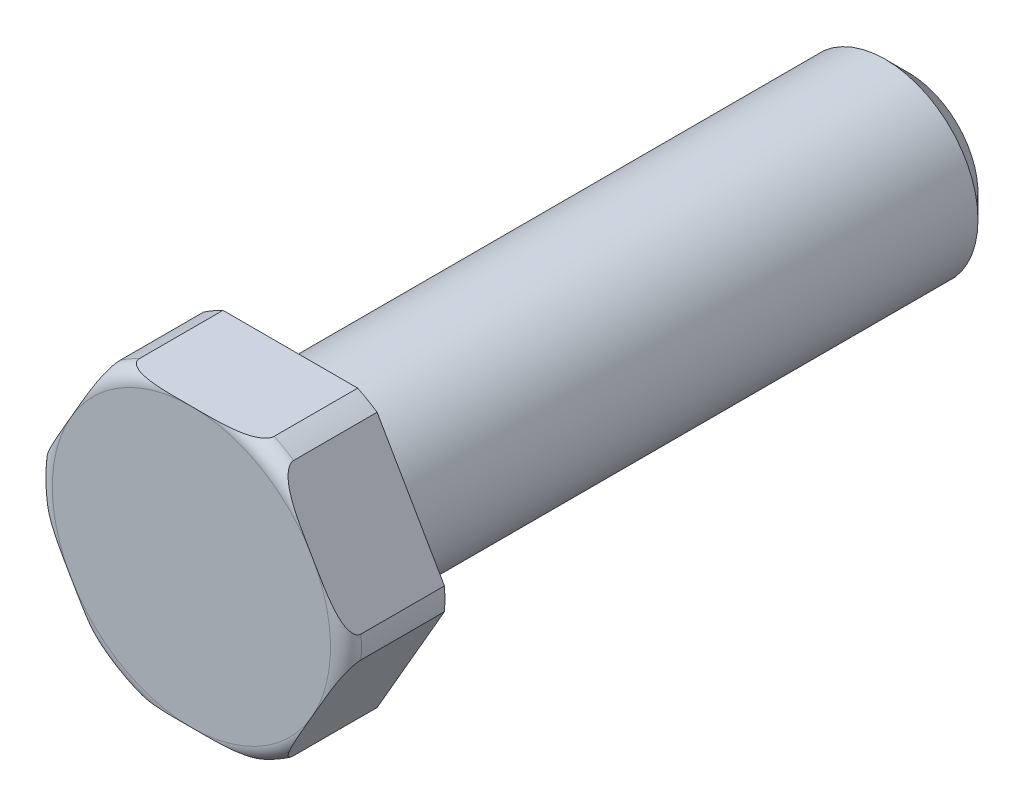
ISO-10303-21;
HEADER;
FILE_DESCRIPTION(('STEP AP214'),'2;1');
FILE_NAME('part.step','',(''),(''),'','','');
FILE_SCHEMA(('AUTOMOTIVE_DESIGN { 1 0 10303 214 1 1 1 1 }'));
ENDSEC;
DATA;
#1=APPLICATION_CONTEXT('core data for automotive mechanical design processes');
#2=APPLICATION_PROTOCOL_DEFINITION('international standard','automotive_design',2000,#1);
#3=PRODUCT_CONTEXT('',#1,'mechanical');
#4=PRODUCT('Part','Part','',(#3));
#5=PRODUCT_RELATED_PRODUCT_CATEGORY('part','',(#4));
#6=PRODUCT_DEFINITION_FORMATION('','',#4);
#7=PRODUCT_DEFINITION_CONTEXT('part definition',#1,'design');
#8=PRODUCT_DEFINITION('design','',#6,#7);
#9=PRODUCT_DEFINITION_SHAPE('','',#8);
#10=(LENGTH_UNIT() NAMED_UNIT(*) SI_UNIT(.MILLI.,.METRE.));
#11=(NAMED_UNIT(*) PLANE_ANGLE_UNIT() SI_UNIT($,.RADIAN.));
#12=(NAMED_UNIT(*) SI_UNIT($,.STERADIAN.) SOLID_ANGLE_UNIT());
#13=UNCERTAINTY_MEASURE_WITH_UNIT(LENGTH_MEASURE(1.E-05),#10,'distance_accuracy_value','');
#14=(GEOMETRIC_REPRESENTATION_CONTEXT(3) GLOBAL_UNCERTAINTY_ASSIGNED_CONTEXT((#13)) GLOBAL_UNIT_ASSIGNED_CONTEXT((#10,
#11,#12)) REPRESENTATION_CONTEXT('',''));
#15=CARTESIAN_POINT('',(0.,0.,0.));
#16=DIRECTION('',(0.,0.,1.));
#17=DIRECTION('',(1.,0.,0.));
#18=AXIS2_PLACEMENT_3D('',#15,#16,#17);
#19=CARTESIAN_POINT('',(0.,0.,0.));
#20=DIRECTION('',(0.,0.,1.));
#21=DIRECTION('',(1.,0.,0.));
#22=AXIS2_PLACEMENT_3D('',#19,#20,#21);
#23=PLANE('',#22);
#24=DIRECTION('',(0.5,0.866025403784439,0.));
#25=VECTOR('',#24,1.);
#26=CARTESIAN_POINT('',(5.19615242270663,-9.,0.));
#27=LINE('',#26,#25);
#28=CARTESIAN_POINT('',(5.61477916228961,-8.27491721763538,0.));
#29=VERTEX_POINT('',#28);
#30=CARTESIAN_POINT('',(9.97367810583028,-0.725082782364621,0.));
#31=VERTEX_POINT('',#30);
#32=EDGE_CURVE('E334',#29,#31,#27,.T.);
#33=ORIENTED_EDGE('',*,*,#32,.F.);
#34=CARTESIAN_POINT('',(0.,0.,0.));
#35=DIRECTION('',(0.,0.,1.));
#36=DIRECTION('',(1.,0.,0.));
#37=AXIS2_PLACEMENT_3D('',#34,#35,#36);
#38=CIRCLE('',#37,10.);
#39=CARTESIAN_POINT('',(4.35889894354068,-9.,0.));
#40=VERTEX_POINT('',#39);
#41=EDGE_CURVE('E306',#40,#29,#38,.T.);
#42=ORIENTED_EDGE('',*,*,#41,.F.);
#43=DIRECTION('',(1.,0.,0.));
#44=VECTOR('',#43,1.);
#45=CARTESIAN_POINT('',(-5.19615242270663,-9.,0.));
#46=LINE('',#45,#44);
#47=CARTESIAN_POINT('',(-4.35889894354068,-9.,0.));
#48=VERTEX_POINT('',#47);
#49=EDGE_CURVE('E325',#48,#40,#46,.T.);
#50=ORIENTED_EDGE('',*,*,#49,.F.);
#51=CARTESIAN_POINT('',(-5.61477916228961,-8.27491721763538,0.));
#52=VERTEX_POINT('',#51);
#53=EDGE_CURVE('E311',#52,#48,#38,.T.);
#54=ORIENTED_EDGE('',*,*,#53,.F.);
#55=DIRECTION('',(0.5,-0.866025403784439,0.));
#56=VECTOR('',#55,1.);
#57=CARTESIAN_POINT('',(-10.3923048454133,0.,0.));
#58=LINE('',#57,#56);
#59=CARTESIAN_POINT('',(-9.97367810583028,-0.725082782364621,0.));
#60=VERTEX_POINT('',#59);
#61=EDGE_CURVE('E323',#60,#52,#58,.T.);
#62=ORIENTED_EDGE('',*,*,#61,.F.);
#63=CARTESIAN_POINT('',(-9.97367810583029,0.725082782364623,0.));
#64=VERTEX_POINT('',#63);
#65=EDGE_CURVE('E314',#64,#60,#38,.T.);
#66=ORIENTED_EDGE('',*,*,#65,.F.);
#67=DIRECTION('',(-0.5,-0.866025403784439,0.));
#68=VECTOR('',#67,1.);
#69=CARTESIAN_POINT('',(-5.19615242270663,9.,0.));
#70=LINE('',#69,#68);
#71=CARTESIAN_POINT('',(-5.61477916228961,8.27491721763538,0.));
#72=VERTEX_POINT('',#71);
#73=EDGE_CURVE('E328',#72,#64,#70,.T.);
#74=ORIENTED_EDGE('',*,*,#73,.F.);
#75=CARTESIAN_POINT('',(-4.35889894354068,9.,0.));
#76=VERTEX_POINT('',#75);
#77=EDGE_CURVE('E312',#76,#72,#38,.T.);
#78=ORIENTED_EDGE('',*,*,#77,.F.);
#79=DIRECTION('',(-1.,0.,0.));
#80=VECTOR('',#79,1.);
#81=CARTESIAN_POINT('',(5.19615242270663,9.,0.));
#82=LINE('',#81,#80);
#83=CARTESIAN_POINT('',(4.35889894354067,9.,0.));
#84=VERTEX_POINT('',#83);
#85=EDGE_CURVE('E333',#84,#76,#82,.T.);
#86=ORIENTED_EDGE('',*,*,#85,.F.);
#87=CARTESIAN_POINT('',(5.6147791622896,8.27491721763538,0.));
#88=VERTEX_POINT('',#87);
#89=EDGE_CURVE('E162',#88,#84,#38,.T.);
#90=ORIENTED_EDGE('',*,*,#89,.F.);
#91=DIRECTION('',(-0.5,0.866025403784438,0.));
#92=VECTOR('',#91,1.);
#93=CARTESIAN_POINT('',(10.3923048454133,0.,0.));
#94=LINE('',#93,#92);
#95=CARTESIAN_POINT('',(9.97367810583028,0.725082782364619,0.));
#96=VERTEX_POINT('',#95);
#97=EDGE_CURVE('E332',#96,#88,#94,.T.);
#98=ORIENTED_EDGE('',*,*,#97,.F.);
#99=EDGE_CURVE('E171',#31,#96,#38,.T.);
#100=ORIENTED_EDGE('',*,*,#99,.F.);
#101=EDGE_LOOP('',(#33,#42,#50,#54,#62,#66,#74,#78,#86,#90,#98,#100));
#102=FACE_BOUND('',#101,.T.);
#103=CARTESIAN_POINT('',(0.,0.,0.));
#104=DIRECTION('',(0.,0.,1.));
#105=DIRECTION('',(1.,0.,0.));
#106=AXIS2_PLACEMENT_3D('',#103,#104,#105);
#107=CIRCLE('',#106,6.);
#108=CARTESIAN_POINT('',(6.,0.,0.));
#109=VERTEX_POINT('',#108);
#110=EDGE_CURVE('E211',#109,#109,#107,.F.);
#111=ORIENTED_EDGE('',*,*,#110,.F.);
#112=EDGE_LOOP('',(#111));
#113=FACE_BOUND('',#112,.T.);
#114=ADVANCED_FACE('F24',(#102,#113),#23,.F.);
#115=CARTESIAN_POINT('',(0.,0.,6.4));
#116=DIRECTION('',(0.,0.,-1.));
#117=DIRECTION('',(-1.,0.,0.));
#118=AXIS2_PLACEMENT_3D('',#115,#116,#117);
#119=CYLINDRICAL_SURFACE('',#118,10.);
#120=DIRECTION('',(0.,0.,-1.));
#121=VECTOR('',#120,1.);
#122=CARTESIAN_POINT('',(5.61477916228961,-8.27491721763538,6.4));
#123=LINE('',#122,#121);
#124=CARTESIAN_POINT('',(5.61477916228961,-8.27491721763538,5.4));
#125=VERTEX_POINT('',#124);
#126=EDGE_CURVE('E304',#125,#29,#123,.T.);
#127=ORIENTED_EDGE('',*,*,#126,.F.);
#128=CARTESIAN_POINT('',(0.,0.,5.4));
#129=DIRECTION('',(0.,0.,1.));
#130=DIRECTION('',(1.,0.,0.));
#131=AXIS2_PLACEMENT_3D('',#128,#129,#130);
#132=CIRCLE('',#131,10.);
#133=CARTESIAN_POINT('',(4.35889894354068,-9.,5.4));
#134=VERTEX_POINT('',#133);
#135=EDGE_CURVE('E141',#125,#134,#132,.F.);
#136=ORIENTED_EDGE('',*,*,#135,.T.);
#137=DIRECTION('',(0.,0.,-1.));
#138=VECTOR('',#137,1.);
#139=CARTESIAN_POINT('',(4.35889894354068,-9.,6.4));
#140=LINE('',#139,#138);
#141=EDGE_CURVE('E299',#40,#134,#140,.F.);
#142=ORIENTED_EDGE('',*,*,#141,.F.);
#143=ORIENTED_EDGE('',*,*,#41,.T.);
#144=EDGE_LOOP('',(#127,#136,#142,#143));
#145=FACE_BOUND('',#144,.T.);
#146=ADVANCED_FACE('F26',(#145),#119,.T.);
#147=DIRECTION('',(0.,0.,-1.));
#148=VECTOR('',#147,1.);
#149=CARTESIAN_POINT('',(9.97367810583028,-0.725082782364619,6.4));
#150=LINE('',#149,#148);
#151=CARTESIAN_POINT('',(9.97367810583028,-0.725082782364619,5.4));
#152=VERTEX_POINT('',#151);
#153=EDGE_CURVE('E303',#31,#152,#150,.F.);
#154=ORIENTED_EDGE('',*,*,#153,.F.);
#155=ORIENTED_EDGE('',*,*,#99,.T.);
#156=DIRECTION('',(0.,0.,-1.));
#157=VECTOR('',#156,1.);
#158=CARTESIAN_POINT('',(9.97367810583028,0.725082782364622,6.4));
#159=LINE('',#158,#157);
#160=CARTESIAN_POINT('',(9.97367810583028,0.72508278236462,5.4));
#161=VERTEX_POINT('',#160);
#162=EDGE_CURVE('E290',#161,#96,#159,.T.);
#163=ORIENTED_EDGE('',*,*,#162,.F.);
#164=EDGE_CURVE('E152',#161,#152,#132,.F.);
#165=ORIENTED_EDGE('',*,*,#164,.T.);
#166=EDGE_LOOP('',(#154,#155,#163,#165));
#167=FACE_BOUND('',#166,.T.);
#168=ADVANCED_FACE('F233',(#167),#119,.T.);
#169=DIRECTION('',(0.,0.,-1.));
#170=VECTOR('',#169,1.);
#171=CARTESIAN_POINT('',(-4.35889894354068,-9.,6.4));
#172=LINE('',#171,#170);
#173=CARTESIAN_POINT('',(-4.35889894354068,-9.,5.4));
#174=VERTEX_POINT('',#173);
#175=EDGE_CURVE('E301',#174,#48,#172,.T.);
#176=ORIENTED_EDGE('',*,*,#175,.F.);
#177=CARTESIAN_POINT('',(-5.61477916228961,-8.27491721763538,5.4));
#178=VERTEX_POINT('',#177);
#179=EDGE_CURVE('E262',#174,#178,#132,.F.);
#180=ORIENTED_EDGE('',*,*,#179,.T.);
#181=DIRECTION('',(0.,0.,-1.));
#182=VECTOR('',#181,1.);
#183=CARTESIAN_POINT('',(-5.61477916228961,-8.27491721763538,6.4));
#184=LINE('',#183,#182);
#185=EDGE_CURVE('E295',#52,#178,#184,.F.);
#186=ORIENTED_EDGE('',*,*,#185,.F.);
#187=ORIENTED_EDGE('',*,*,#53,.T.);
#188=EDGE_LOOP('',(#176,#180,#186,#187));
#189=FACE_BOUND('',#188,.T.);
#190=ADVANCED_FACE('F320',(#189),#119,.T.);
#191=DIRECTION('',(0.,0.,-1.));
#192=VECTOR('',#191,1.);
#193=CARTESIAN_POINT('',(-9.97367810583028,-0.725082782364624,6.4));
#194=LINE('',#193,#192);
#195=CARTESIAN_POINT('',(-9.97367810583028,-0.725082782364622,5.4));
#196=VERTEX_POINT('',#195);
#197=EDGE_CURVE('E297',#196,#60,#194,.T.);
#198=ORIENTED_EDGE('',*,*,#197,.F.);
#199=CARTESIAN_POINT('',(-9.97367810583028,0.725082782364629,5.4));
#200=VERTEX_POINT('',#199);
#201=EDGE_CURVE('E264',#196,#200,#132,.F.);
#202=ORIENTED_EDGE('',*,*,#201,.T.);
#203=DIRECTION('',(0.,0.,-1.));
#204=VECTOR('',#203,1.);
#205=CARTESIAN_POINT('',(-9.97367810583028,0.725082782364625,6.4));
#206=LINE('',#205,#204);
#207=EDGE_CURVE('E285',#64,#200,#206,.F.);
#208=ORIENTED_EDGE('',*,*,#207,.F.);
#209=ORIENTED_EDGE('',*,*,#65,.T.);
#210=EDGE_LOOP('',(#198,#202,#208,#209));
#211=FACE_BOUND('',#210,.T.);
#212=ADVANCED_FACE('F342',(#211),#119,.T.);
#213=DIRECTION('',(0.,0.,-1.));
#214=VECTOR('',#213,1.);
#215=CARTESIAN_POINT('',(-5.61477916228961,8.27491721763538,6.4));
#216=LINE('',#215,#214);
#217=CARTESIAN_POINT('',(-5.61477916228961,8.27491721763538,5.4));
#218=VERTEX_POINT('',#217);
#219=EDGE_CURVE('E288',#218,#72,#216,.T.);
#220=ORIENTED_EDGE('',*,*,#219,.F.);
#221=CARTESIAN_POINT('',(-4.35889894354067,9.,5.4));
#222=VERTEX_POINT('',#221);
#223=EDGE_CURVE('E270',#218,#222,#132,.F.);
#224=ORIENTED_EDGE('',*,*,#223,.T.);
#225=DIRECTION('',(0.,0.,-1.));
#226=VECTOR('',#225,1.);
#227=CARTESIAN_POINT('',(-4.35889894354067,9.,6.4));
#228=LINE('',#227,#226);
#229=EDGE_CURVE('E286',#76,#222,#228,.F.);
#230=ORIENTED_EDGE('',*,*,#229,.F.);
#231=ORIENTED_EDGE('',*,*,#77,.T.);
#232=EDGE_LOOP('',(#220,#224,#230,#231));
#233=FACE_BOUND('',#232,.T.);
#234=ADVANCED_FACE('F255',(#233),#119,.T.);
#235=DIRECTION('',(0.,0.,-1.));
#236=VECTOR('',#235,1.);
#237=CARTESIAN_POINT('',(4.35889894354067,9.,6.4));
#238=LINE('',#237,#236);
#239=CARTESIAN_POINT('',(4.35889894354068,9.,5.4));
#240=VERTEX_POINT('',#239);
#241=EDGE_CURVE('E283',#240,#84,#238,.T.);
#242=ORIENTED_EDGE('',*,*,#241,.F.);
#243=CARTESIAN_POINT('',(5.6147791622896,8.27491721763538,5.4));
#244=VERTEX_POINT('',#243);
#245=EDGE_CURVE('E167',#240,#244,#132,.F.);
#246=ORIENTED_EDGE('',*,*,#245,.T.);
#247=DIRECTION('',(0.,0.,-1.));
#248=VECTOR('',#247,1.);
#249=CARTESIAN_POINT('',(5.6147791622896,8.27491721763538,6.4));
#250=LINE('',#249,#248);
#251=EDGE_CURVE('E136',#88,#244,#250,.F.);
#252=ORIENTED_EDGE('',*,*,#251,.F.);
#253=ORIENTED_EDGE('',*,*,#89,.T.);
#254=EDGE_LOOP('',(#242,#246,#252,#253));
#255=FACE_BOUND('',#254,.T.);
#256=ADVANCED_FACE('F235',(#255),#119,.T.);
#257=CARTESIAN_POINT('',(0.,0.,5.4));
#258=DIRECTION('',(0.,0.,1.));
#259=DIRECTION('',(1.,0.,0.));
#260=AXIS2_PLACEMENT_3D('',#257,#258,#259);
#261=TOROIDAL_SURFACE('',#260,9.,1.);
#262=ORIENTED_EDGE('',*,*,#135,.F.);
#263=CARTESIAN_POINT('',(5.61477918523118,-8.27491717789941,5.3998));
#264=CARTESIAN_POINT('',(5.61473988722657,-8.27498524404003,5.42641958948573));
#265=CARTESIAN_POINT('',(5.61598444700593,-8.27282960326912,5.45295658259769));
#266=CARTESIAN_POINT('',(5.62073760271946,-8.26459689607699,5.50492186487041));
#267=CARTESIAN_POINT('',(5.62422152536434,-8.25856256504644,5.53035905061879));
#268=CARTESIAN_POINT('',(5.63414682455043,-8.24137144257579,5.58523645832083));
#269=CARTESIAN_POINT('',(5.64107097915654,-8.22937845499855,5.61432234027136));
#270=CARTESIAN_POINT('',(5.65719353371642,-8.20145337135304,5.66994085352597));
#271=CARTESIAN_POINT('',(5.66640185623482,-8.18550408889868,5.69646162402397));
#272=CARTESIAN_POINT('',(5.69191860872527,-8.14130777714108,5.76044553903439));
#273=CARTESIAN_POINT('',(5.70937262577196,-8.11107653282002,5.79606346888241));
#274=CARTESIAN_POINT('',(5.74670451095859,-8.04641581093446,5.86169714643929));
#275=CARTESIAN_POINT('',(5.76658711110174,-8.01197813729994,5.89170165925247));
#276=CARTESIAN_POINT('',(5.80702352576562,-7.94194021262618,5.94589521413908));
#277=CARTESIAN_POINT('',(5.82751459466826,-7.90644864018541,5.97027484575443));
#278=CARTESIAN_POINT('',(5.86946062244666,-7.83379598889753,6.01549838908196));
#279=CARTESIAN_POINT('',(5.89091649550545,-7.79663332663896,6.03633885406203));
#280=CARTESIAN_POINT('',(5.93452763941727,-7.7210966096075,6.07508206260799));
#281=CARTESIAN_POINT('',(5.95668428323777,-7.68272017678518,6.0929785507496));
#282=CARTESIAN_POINT('',(6.00145148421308,-7.60518111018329,6.12623362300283));
#283=CARTESIAN_POINT('',(6.02406182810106,-7.5660188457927,6.14159336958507));
#284=CARTESIAN_POINT('',(6.08379666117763,-7.46255507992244,6.17905484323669));
#285=CARTESIAN_POINT('',(6.12119563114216,-7.39777816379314,6.1994024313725));
#286=CARTESIAN_POINT('',(6.19653557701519,-7.26728554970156,6.2356534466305));
#287=CARTESIAN_POINT('',(6.23447686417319,-7.20156931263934,6.25155420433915));
#288=CARTESIAN_POINT('',(6.31076099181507,-7.06944132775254,6.27981637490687));
#289=CARTESIAN_POINT('',(6.34910448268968,-7.00302845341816,6.29217065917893));
#290=CARTESIAN_POINT('',(6.42599907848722,-6.86984310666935,6.31398883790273));
#291=CARTESIAN_POINT('',(6.4645502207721,-6.80307056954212,6.32345219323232));
#292=CARTESIAN_POINT('',(6.58075309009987,-6.60180129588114,6.34843949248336));
#293=CARTESIAN_POINT('',(6.6585920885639,-6.46698019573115,6.36043837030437));
#294=CARTESIAN_POINT('',(6.81432960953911,-6.19723489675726,6.37845830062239));
#295=CARTESIAN_POINT('',(6.89222797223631,-6.06231097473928,6.38448591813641));
#296=CARTESIAN_POINT('',(7.05274017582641,-5.7842956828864,6.39324136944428));
#297=CARTESIAN_POINT('',(7.13535669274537,-5.64119967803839,6.39574967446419));
#298=CARTESIAN_POINT('',(7.30061602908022,-5.3549621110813,6.39884223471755));
#299=CARTESIAN_POINT('',(7.38325884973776,-5.21182054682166,6.39942598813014));
#300=CARTESIAN_POINT('',(7.54827087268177,-4.9260113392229,6.40000064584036));
#301=CARTESIAN_POINT('',(7.63064007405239,-4.78334369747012,6.39999350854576));
#302=CARTESIAN_POINT('',(7.79537169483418,-4.49802016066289,6.40000434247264));
#303=CARTESIAN_POINT('',(7.87773411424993,-4.35536426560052,6.40002231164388));
#304=CARTESIAN_POINT('',(8.01563301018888,-4.11651637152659,6.39995368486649));
#305=CARTESIAN_POINT('',(8.07116947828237,-4.02032438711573,6.39989924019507));
#306=CARTESIAN_POINT('',(8.18224213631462,-3.82794090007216,6.39949888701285));
#307=CARTESIAN_POINT('',(8.23777832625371,-3.73174939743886,6.3991529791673));
#308=CARTESIAN_POINT('',(8.34887517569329,-3.53932400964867,6.39779919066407));
#309=CARTESIAN_POINT('',(8.40443583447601,-3.44309012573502,6.39679100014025));
#310=CARTESIAN_POINT('',(8.51554796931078,-3.25063826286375,6.39358876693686));
#311=CARTESIAN_POINT('',(8.57109944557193,-3.15442028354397,6.3913947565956));
#312=CARTESIAN_POINT('',(8.70171952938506,-2.92817966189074,6.384057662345));
#313=CARTESIAN_POINT('',(8.77677848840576,-2.79817373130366,6.37814859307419));
#314=CARTESIAN_POINT('',(8.92680523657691,-2.53831978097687,6.36079543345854));
#315=CARTESIAN_POINT('',(9.00177294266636,-2.40847190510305,6.34934798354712));
#316=CARTESIAN_POINT('',(9.11456827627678,-2.21310465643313,6.32561515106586));
#317=CARTESIAN_POINT('',(9.15256076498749,-2.1472997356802,6.31650017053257));
#318=CARTESIAN_POINT('',(9.22835288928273,-2.01602392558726,6.29551716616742));
#319=CARTESIAN_POINT('',(9.26615255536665,-1.95055298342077,6.28364959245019));
#320=CARTESIAN_POINT('',(9.34141826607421,-1.82018894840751,6.2565285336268));
#321=CARTESIAN_POINT('',(9.37888457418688,-1.75529539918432,6.24127802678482));
#322=CARTESIAN_POINT('',(9.45331847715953,-1.62637209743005,6.20656049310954));
#323=CARTESIAN_POINT('',(9.49028629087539,-1.56234196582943,6.18709538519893));
#324=CARTESIAN_POINT('',(9.56489607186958,-1.4331140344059,6.14195652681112));
#325=CARTESIAN_POINT('',(9.60250577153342,-1.36797212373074,6.11606540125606));
#326=CARTESIAN_POINT('',(9.67628194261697,-1.24018804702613,6.05677292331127));
#327=CARTESIAN_POINT('',(9.71244846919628,-1.17754578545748,6.02337185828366));
#328=CARTESIAN_POINT('',(9.77194468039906,-1.07449532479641,5.95767575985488));
#329=CARTESIAN_POINT('',(9.79595411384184,-1.03290976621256,5.92787199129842));
#330=CARTESIAN_POINT('',(9.84171515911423,-0.953649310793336,5.86193778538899));
#331=CARTESIAN_POINT('',(9.86347203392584,-0.915965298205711,5.82582265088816));
#332=CARTESIAN_POINT('',(9.89519961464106,-0.861011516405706,5.76192829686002));
#333=CARTESIAN_POINT('',(9.90639962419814,-0.84161253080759,5.73660797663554));
#334=CARTESIAN_POINT('',(9.92687401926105,-0.806149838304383,5.68298873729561));
#335=CARTESIAN_POINT('',(9.93615054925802,-0.790082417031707,5.65469318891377));
#336=CARTESIAN_POINT('',(9.95054740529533,-0.765146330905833,5.60093509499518));
#337=CARTESIAN_POINT('',(9.95612323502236,-0.75548871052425,5.57596481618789));
#338=CARTESIAN_POINT('',(9.96512608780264,-0.739895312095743,5.52453692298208));
#339=CARTESIAN_POINT('',(9.96855857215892,-0.733950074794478,5.49808327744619));
#340=CARTESIAN_POINT('',(9.97172993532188,-0.72845711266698,5.45944868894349));
#341=CARTESIAN_POINT('',(9.97246079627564,-0.727191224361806,5.44757189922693));
#342=CARTESIAN_POINT('',(9.97343673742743,-0.725500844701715,5.42373223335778));
#343=CARTESIAN_POINT('',(9.97368154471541,-0.725076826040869,5.41176931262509));
#344=CARTESIAN_POINT('',(9.97367808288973,-0.725082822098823,5.39980000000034));
#345=B_SPLINE_CURVE_WITH_KNOTS('',3,(#263,#264,#265,#266,#267,#268,#269,#270,#271,#272,#273,
#274,#275,#276,#277,#278,#279,#280,#281,#282,#283,#284,#285,#286,#287,#288,#289,#290,#291,#292,
#293,#294,#295,#296,#297,#298,#299,#300,#301,#302,#303,#304,#305,#306,#307,#308,#309,#310,#311,
#312,#313,#314,#315,#316,#317,#318,#319,#320,#321,#322,#323,#324,#325,#326,#327,#328,#329,#330,
#331,#332,#333,#334,#335,#336,#337,#338,#339,#340,#341,#342,#343,#344),.UNSPECIFIED.,.F.,.F.,(4,
2,2,2,2,2,2,2,2,2,2,2,2,2,2,2,2,2,2,2,2,2,2,2,2,2,2,2,2,2,2,2,2,2,2,2,2,2,2,2,4),(0.,
0.0796060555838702,0.158349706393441,0.254459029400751,0.35099340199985,0.499768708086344,
0.648838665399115,0.791680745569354,0.934661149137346,1.07794154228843,1.22115609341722,
1.4535104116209,1.68600391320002,1.91896151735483,2.15196253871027,2.62016410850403,
3.08785034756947,3.58357943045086,4.07943776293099,4.57365272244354,5.06782732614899,
5.40104608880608,5.73426409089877,6.06763810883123,6.4010030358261,6.85165502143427,
7.30258071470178,7.53213122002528,7.76164421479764,7.99095594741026,8.2201634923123,
8.45854789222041,8.69692317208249,8.86613068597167,9.03493348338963,9.13609342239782,
9.2371399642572,9.31887242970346,9.40039577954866,9.43626072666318,9.47214580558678),.UNSPECIFIED.);
#346=CARTESIAN_POINT('',(7.79422895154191,-4.49999945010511,6.4));
#347=VERTEX_POINT('',#346);
#348=EDGE_CURVE('E205',#125,#347,#345,.T.);
#349=ORIENTED_EDGE('',*,*,#348,.T.);
#350=CARTESIAN_POINT('',(0.,0.,6.4));
#351=DIRECTION('',(0.,0.,1.));
#352=DIRECTION('',(1.,0.,0.));
#353=AXIS2_PLACEMENT_3D('',#350,#351,#352);
#354=CIRCLE('',#353,9.);
#355=CARTESIAN_POINT('',(0.,-9.,6.4));
#356=VERTEX_POINT('',#355);
#357=EDGE_CURVE('E161',#356,#347,#354,.T.);
#358=ORIENTED_EDGE('',*,*,#357,.F.);
#359=CARTESIAN_POINT('',(0.,-9.,6.4000000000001));
#360=CARTESIAN_POINT('',(0.166644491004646,-9.,6.40000389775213));
#361=CARTESIAN_POINT('',(0.333288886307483,-9.,6.40003309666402));
#362=CARTESIAN_POINT('',(0.666617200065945,-9.,6.39977436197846));
#363=CARTESIAN_POINT('',(0.833301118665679,-9.,6.39948635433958));
#364=CARTESIAN_POINT('',(1.16672058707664,-9.,6.39744364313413));
#365=CARTESIAN_POINT('',(1.33345613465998,-9.,6.39568842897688));
#366=CARTESIAN_POINT('',(1.66684118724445,-9.,6.38883393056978));
#367=CARTESIAN_POINT('',(1.83349070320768,-9.,6.38373541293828));
#368=CARTESIAN_POINT('',(2.11280578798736,-9.,6.37009265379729));
#369=CARTESIAN_POINT('',(2.22554721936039,-9.,6.3631901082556));
#370=CARTESIAN_POINT('',(2.45071908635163,-9.,6.34546883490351));
#371=CARTESIAN_POINT('',(2.56314957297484,-9.,6.33465079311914));
#372=CARTESIAN_POINT('',(2.78752585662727,-9.,6.30763977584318));
#373=CARTESIAN_POINT('',(2.89947086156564,-9.,6.29144002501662));
#374=CARTESIAN_POINT('',(3.12203762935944,-9.,6.2517357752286));
#375=CARTESIAN_POINT('',(3.23266049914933,-9.,6.22823790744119));
#376=CARTESIAN_POINT('',(3.3971434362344,-9.,6.18523164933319));
#377=CARTESIAN_POINT('',(3.45199081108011,-9.,6.16950782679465));
#378=CARTESIAN_POINT('',(3.56068718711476,-9.,6.13494745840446));
#379=CARTESIAN_POINT('',(3.61453659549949,-9.,6.11611221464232));
#380=CARTESIAN_POINT('',(3.72051717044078,-9.,6.07478106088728));
#381=CARTESIAN_POINT('',(3.77265561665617,-9.,6.05230403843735));
#382=CARTESIAN_POINT('',(3.87469849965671,-9.,6.00280198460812));
#383=CARTESIAN_POINT('',(3.92460594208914,-9.,5.97578332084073));
#384=CARTESIAN_POINT('',(4.00521404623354,-9.,5.92582207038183));
#385=CARTESIAN_POINT('',(4.03686803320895,-9.,5.9044263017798));
#386=CARTESIAN_POINT('',(4.09799960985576,-9.,5.85860493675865));
#387=CARTESIAN_POINT('',(4.12747453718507,-9.,5.83417572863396));
#388=CARTESIAN_POINT('',(4.18350124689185,-9.,5.7816281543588));
#389=CARTESIAN_POINT('',(4.21002362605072,-9.,5.7534779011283));
#390=CARTESIAN_POINT('',(4.25829856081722,-9.,5.69332642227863));
#391=CARTESIAN_POINT('',(4.28006186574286,-9.,5.66133413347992));
#392=CARTESIAN_POINT('',(4.31119233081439,-9.,5.60390037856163));
#393=CARTESIAN_POINT('',(4.32231700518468,-9.,5.5794183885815));
#394=CARTESIAN_POINT('',(4.34046541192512,-9.,5.52897286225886));
#395=CARTESIAN_POINT('',(4.34749348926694,-9.,5.50301092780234));
#396=CARTESIAN_POINT('',(4.35683807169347,-9.,5.45005850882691));
#397=CARTESIAN_POINT('',(4.35912365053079,-9.,5.42306243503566));
#398=CARTESIAN_POINT('',(4.35863913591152,-9.,5.36911420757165));
#399=CARTESIAN_POINT('',(4.35586887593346,-9.,5.34216205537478));
#400=CARTESIAN_POINT('',(4.34600652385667,-9.,5.29141158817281));
#401=CARTESIAN_POINT('',(4.33929285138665,-9.,5.26753735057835));
#402=CARTESIAN_POINT('',(4.32240121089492,-9.,5.22106233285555));
#403=CARTESIAN_POINT('',(4.31222180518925,-9.,5.19846208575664));
#404=CARTESIAN_POINT('',(4.28295495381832,-9.,5.14339891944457));
#405=CARTESIAN_POINT('',(4.26199008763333,-9.,5.11193668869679));
#406=CARTESIAN_POINT('',(4.21540153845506,-9.,5.05267300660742));
#407=CARTESIAN_POINT('',(4.18976467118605,-9.,5.02488230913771));
#408=CARTESIAN_POINT('',(4.11642679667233,-9.,4.95458205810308));
#409=CARTESIAN_POINT('',(4.06574407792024,-9.,4.91521288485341));
#410=CARTESIAN_POINT('',(3.95937678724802,-9.,4.84412871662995));
#411=CARTESIAN_POINT('',(3.90368182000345,-9.,4.81243015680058));
#412=CARTESIAN_POINT('',(3.77296217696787,-9.,4.7467791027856));
#413=CARTESIAN_POINT('',(3.69696959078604,-9.,4.71478082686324));
#414=CARTESIAN_POINT('',(3.54225051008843,-9.,4.65810429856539));
#415=CARTESIAN_POINT('',(3.46351906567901,-9.,4.63344016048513));
#416=CARTESIAN_POINT('',(3.30409489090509,-9.,4.58966175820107));
#417=CARTESIAN_POINT('',(3.22339379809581,-9.,4.57057853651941));
#418=CARTESIAN_POINT('',(3.06117490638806,-9.,4.53691761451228));
#419=CARTESIAN_POINT('',(2.97965811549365,-9.,4.52233492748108));
#420=CARTESIAN_POINT('',(2.81080344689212,-9.,4.49588930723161));
#421=CARTESIAN_POINT('',(2.7234292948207,-9.,4.48426252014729));
#422=CARTESIAN_POINT('',(2.54831276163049,-9.,4.46416687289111));
#423=CARTESIAN_POINT('',(2.46057031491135,-9.,4.45569860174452));
#424=CARTESIAN_POINT('',(2.19691506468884,-9.,4.43396265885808));
#425=CARTESIAN_POINT('',(2.02070541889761,-9.,4.42438206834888));
#426=CARTESIAN_POINT('',(1.66755297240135,-9.,4.4108948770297));
#427=CARTESIAN_POINT('',(1.49060964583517,-9.,4.40700675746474));
#428=CARTESIAN_POINT('',(1.13676433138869,-9.,4.40210964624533));
#429=CARTESIAN_POINT('',(0.959862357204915,-9.,4.40109945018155));
#430=CARTESIAN_POINT('',(0.605067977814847,-9.,4.40005347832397));
#431=CARTESIAN_POINT('',(0.42717557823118,-9.,4.40002319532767));
#432=CARTESIAN_POINT('',(0.0713722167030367,-9.,4.39998871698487));
#433=CARTESIAN_POINT('',(-0.106538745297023,-9.,4.39998452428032));
#434=CARTESIAN_POINT('',(-0.46203353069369,-9.,4.40003562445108));
#435=CARTESIAN_POINT('',(-0.639617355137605,-9.,4.40009080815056));
#436=CARTESIAN_POINT('',(-0.994776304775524,-9.,4.40128047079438));
#437=CARTESIAN_POINT('',(-1.17235142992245,-9.,4.40241489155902));
#438=CARTESIAN_POINT('',(-1.52759496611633,-9.,4.40774795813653));
#439=CARTESIAN_POINT('',(-1.70526334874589,-9.,4.41194887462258));
#440=CARTESIAN_POINT('',(-2.06070253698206,-9.,4.42639274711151));
#441=CARTESIAN_POINT('',(-2.23847304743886,-9.,4.43664541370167));
#442=CARTESIAN_POINT('',(-2.50346649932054,-9.,4.45975063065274));
#443=CARTESIAN_POINT('',(-2.59102492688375,-9.,4.46866753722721));
#444=CARTESIAN_POINT('',(-2.76573978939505,-9.,4.48977637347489));
#445=CARTESIAN_POINT('',(-2.85289630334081,-9.,4.50196762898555));
#446=CARTESIAN_POINT('',(-3.02633302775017,-9.,4.53048094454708));
#447=CARTESIAN_POINT('',(-3.11261481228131,-9.,4.54679326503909));
#448=CARTESIAN_POINT('',(-3.28398861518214,-9.,4.58471726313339));
#449=CARTESIAN_POINT('',(-3.36908146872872,-9.,4.60632500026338));
#450=CARTESIAN_POINT('',(-3.48481895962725,-9.,4.64083735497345));
#451=CARTESIAN_POINT('',(-3.5163526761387,-9.,4.65077560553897));
#452=CARTESIAN_POINT('',(-3.57905457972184,-9.,4.67175463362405));
#453=CARTESIAN_POINT('',(-3.61022271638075,-9.,4.68279556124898));
#454=CARTESIAN_POINT('',(-3.70323261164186,-9.,4.71782794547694));
#455=CARTESIAN_POINT('',(-3.76440143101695,-9.,4.74367748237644));
#456=CARTESIAN_POINT('',(-3.88428816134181,-9.,4.80186460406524));
#457=CARTESIAN_POINT('',(-3.94297945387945,-9.,4.83425781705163));
#458=CARTESIAN_POINT('',(-4.05502885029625,-9.,4.90720197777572));
#459=CARTESIAN_POINT('',(-4.10840863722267,-9.,4.94771753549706));
#460=CARTESIAN_POINT('',(-4.18040513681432,-9.,5.01558195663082));
#461=CARTESIAN_POINT('',(-4.20275530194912,-9.,5.03894916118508));
#462=CARTESIAN_POINT('',(-4.24432042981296,-9.,5.08838927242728));
#463=CARTESIAN_POINT('',(-4.26353416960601,-9.,5.11446322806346));
#464=CARTESIAN_POINT('',(-4.29788234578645,-9.,5.16969402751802));
#465=CARTESIAN_POINT('',(-4.3129619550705,-9.,5.19888577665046));
#466=CARTESIAN_POINT('',(-4.33724345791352,-9.,5.25961998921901));
#467=CARTESIAN_POINT('',(-4.34645862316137,-9.,5.29115696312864));
#468=CARTESIAN_POINT('',(-4.35721781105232,-9.,5.35206471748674));
#469=CARTESIAN_POINT('',(-4.35947546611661,-9.,5.3813075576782));
#470=CARTESIAN_POINT('',(-4.35807046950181,-9.,5.43965133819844));
#471=CARTESIAN_POINT('',(-4.35440823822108,-9.,5.46875228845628));
#472=CARTESIAN_POINT('',(-4.34259537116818,-9.,5.52139630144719));
#473=CARTESIAN_POINT('',(-4.33520298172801,-9.,5.54511680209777));
#474=CARTESIAN_POINT('',(-4.31705151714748,-9.,5.59121499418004));
#475=CARTESIAN_POINT('',(-4.30629167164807,-9.,5.61359237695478));
#476=CARTESIAN_POINT('',(-4.27513467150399,-9.,5.66904155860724));
#477=CARTESIAN_POINT('',(-4.2527322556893,-9.,5.70098346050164));
#478=CARTESIAN_POINT('',(-4.20323690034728,-9.,5.76099906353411));
#479=CARTESIAN_POINT('',(-4.17613044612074,-9.,5.78906118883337));
#480=CARTESIAN_POINT('',(-4.09812751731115,-9.,5.86057549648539));
#481=CARTESIAN_POINT('',(-4.04412584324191,-9.,5.90060773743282));
#482=CARTESIAN_POINT('',(-3.93108619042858,-9.,5.97261141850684));
#483=CARTESIAN_POINT('',(-3.87203632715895,-9.,6.00456309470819));
#484=CARTESIAN_POINT('',(-3.73165785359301,-9.,6.07144991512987));
#485=CARTESIAN_POINT('',(-3.6492426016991,-9.,6.10407259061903));
#486=CARTESIAN_POINT('',(-3.4816469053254,-9.,6.16139324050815));
#487=CARTESIAN_POINT('',(-3.39646132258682,-9.,6.18607544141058));
#488=CARTESIAN_POINT('',(-3.22416216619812,-9.,6.22948767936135));
#489=CARTESIAN_POINT('',(-3.1370410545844,-9.,6.24818717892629));
#490=CARTESIAN_POINT('',(-2.96202422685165,-9.,6.28083614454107));
#491=CARTESIAN_POINT('',(-2.87412931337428,-9.,6.29479004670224));
#492=CARTESIAN_POINT('',(-2.67085302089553,-9.,6.32272038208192));
#493=CARTESIAN_POINT('',(-2.5552961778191,-9.,6.33539541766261));
#494=CARTESIAN_POINT('',(-2.32376304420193,-9.,6.35619176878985));
#495=CARTESIAN_POINT('',(-2.20778663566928,-9.,6.36431168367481));
#496=CARTESIAN_POINT('',(-1.97551701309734,-9.,6.37730344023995));
#497=CARTESIAN_POINT('',(-1.85922358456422,-9.,6.38217124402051));
#498=CARTESIAN_POINT('',(-1.62656320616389,-9.,6.38967250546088));
#499=CARTESIAN_POINT('',(-1.51019625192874,-9.,6.39230581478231));
#500=CARTESIAN_POINT('',(-1.2776417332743,-9.,6.39614641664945));
#501=CARTESIAN_POINT('',(-1.1614542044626,-9.,6.3973561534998));
#502=CARTESIAN_POINT('',(-0.929072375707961,-9.,6.39898080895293));
#503=CARTESIAN_POINT('',(-0.812878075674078,-9.,6.3993957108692));
#504=CARTESIAN_POINT('',(-0.580569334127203,-9.,6.39987905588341));
#505=CARTESIAN_POINT('',(-0.46445489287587,-9.,6.39994773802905));
#506=CARTESIAN_POINT('',(-0.232226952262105,-9.,6.40000685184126));
#507=CARTESIAN_POINT('',(-0.116113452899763,-9.,6.39999728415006));
#508=CARTESIAN_POINT('',(0.,-9.,6.4000000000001));
#509=B_SPLINE_CURVE_WITH_KNOTS('',3,(#359,#360,#361,#362,#363,#364,#365,#366,#367,#368,#369,
#370,#371,#372,#373,#374,#375,#376,#377,#378,#379,#380,#381,#382,#383,#384,#385,#386,#387,#388,
#389,#390,#391,#392,#393,#394,#395,#396,#397,#398,#399,#400,#401,#402,#403,#404,#405,#406,#407,
#408,#409,#410,#411,#412,#413,#414,#415,#416,#417,#418,#419,#420,#421,#422,#423,#424,#425,#426,
#427,#428,#429,#430,#431,#432,#433,#434,#435,#436,#437,#438,#439,#440,#441,#442,#443,#444,#445,
#446,#447,#448,#449,#450,#451,#452,#453,#454,#455,#456,#457,#458,#459,#460,#461,#462,#463,#464,
#465,#466,#467,#468,#469,#470,#471,#472,#473,#474,#475,#476,#477,#478,#479,#480,#481,#482,#483,
#484,#485,#486,#487,#488,#489,#490,#491,#492,#493,#494,#495,#496,#497,#498,#499,#500,#501,#502,
#503,#504,#505,#506,#507,#508),.UNSPECIFIED.,.T.,.F.,(4,2,2,2,2,2,2,2,2,2,2,2,2,2,2,2,2,2,2,2,2,
2,2,2,2,2,2,2,2,2,2,2,2,2,2,2,2,2,2,2,2,2,2,2,2,2,2,2,2,2,2,2,2,2,2,2,2,2,2,2,2,2,2,2,2,2,2,2,2,
2,2,2,2,2,4),(0.,0.499933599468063,0.999983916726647,1.50020832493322,2.00031807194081,
2.33912962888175,2.67788185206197,3.01706217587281,3.35593521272,3.52703455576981,
3.69806247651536,3.86823022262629,4.03816134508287,4.15264244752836,4.26726118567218,
4.38293492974,4.49834463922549,4.57872060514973,4.65901116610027,4.73982368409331,
4.82063886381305,4.89473585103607,4.9688636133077,5.08163633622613,5.19473237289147,
5.38617588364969,5.57802602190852,5.82481808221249,6.07208205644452,6.32069630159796,
6.56903407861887,6.83339257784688,7.09780035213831,7.62701220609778,8.1579384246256,
8.68864241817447,9.22232070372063,9.75605302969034,10.2888056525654,10.8215295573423,
11.3546483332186,11.888624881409,12.1526130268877,12.4165468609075,12.6798626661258,
12.942983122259,13.0421532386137,13.1413368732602,13.3402599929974,13.5409512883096,
13.7407864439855,13.8375892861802,13.9344297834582,14.0324984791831,14.1303444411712,
14.2177496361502,14.3051486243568,14.3793973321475,14.4536630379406,14.5700351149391,
14.686747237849,14.8872741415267,15.0882868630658,15.3535698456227,15.6193765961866,
15.8865192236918,16.1534114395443,16.5020260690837,16.8507478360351,17.1999017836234,
17.5490789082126,17.8976556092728,18.2462396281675,18.5945829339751,18.9429233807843),.UNSPECIFIED.);
#510=EDGE_CURVE('E39',#356,#134,#509,.T.);
#511=ORIENTED_EDGE('',*,*,#510,.T.);
#512=EDGE_LOOP('',(#262,#349,#358,#511));
#513=FACE_BOUND('',#512,.T.);
#514=ADVANCED_FACE('F183',(#513),#261,.T.);
#515=CARTESIAN_POINT('',(7.79422674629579,4.50000326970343,6.4));
#516=VERTEX_POINT('',#515);
#517=EDGE_CURVE('E149',#347,#516,#354,.T.);
#518=ORIENTED_EDGE('',*,*,#517,.F.);
#519=EDGE_CURVE('E199',#347,#152,#345,.T.);
#520=ORIENTED_EDGE('',*,*,#519,.T.);
#521=ORIENTED_EDGE('',*,*,#164,.F.);
#522=CARTESIAN_POINT('',(9.97367808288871,0.725082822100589,5.3998));
#523=CARTESIAN_POINT('',(9.97371738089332,0.725014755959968,5.42641958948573));
#524=CARTESIAN_POINT('',(9.97247282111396,0.727170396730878,5.45295658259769));
#525=CARTESIAN_POINT('',(9.96771966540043,0.735403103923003,5.50492186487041));
#526=CARTESIAN_POINT('',(9.96423574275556,0.741437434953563,5.53035905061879));
#527=CARTESIAN_POINT('',(9.95431044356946,0.758628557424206,5.58523645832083));
#528=CARTESIAN_POINT('',(9.94738628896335,0.770621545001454,5.61432234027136));
#529=CARTESIAN_POINT('',(9.93126373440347,0.798546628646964,5.66994085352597));
#530=CARTESIAN_POINT('',(9.92205541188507,0.814495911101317,5.69646162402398));
#531=CARTESIAN_POINT('',(9.89653865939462,0.858692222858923,5.7604455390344));
#532=CARTESIAN_POINT('',(9.87908464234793,0.888923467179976,5.79606346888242));
#533=CARTESIAN_POINT('',(9.8417527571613,0.953584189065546,5.8616971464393));
#534=CARTESIAN_POINT('',(9.82187015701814,0.988021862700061,5.89170165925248));
#535=CARTESIAN_POINT('',(9.78143374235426,1.05805978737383,5.94589521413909));
#536=CARTESIAN_POINT('',(9.76094267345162,1.0935513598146,5.97027484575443));
#537=CARTESIAN_POINT('',(9.71899664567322,1.16620401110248,6.01549838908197));
#538=CARTESIAN_POINT('',(9.69754077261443,1.20336667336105,6.03633885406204));
#539=CARTESIAN_POINT('',(9.65392962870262,1.27890339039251,6.07508206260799));
#540=CARTESIAN_POINT('',(9.63177298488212,1.31727982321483,6.09297855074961));
#541=CARTESIAN_POINT('',(9.5870057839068,1.39481888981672,6.12623362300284));
#542=CARTESIAN_POINT('',(9.56439544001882,1.43398115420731,6.14159336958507));
#543=CARTESIAN_POINT('',(9.50466060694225,1.53744492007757,6.1790548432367));
#544=CARTESIAN_POINT('',(9.46726163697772,1.60222183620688,6.19940243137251));
#545=CARTESIAN_POINT('',(9.39192169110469,1.73271445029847,6.23565344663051));
#546=CARTESIAN_POINT('',(9.35398040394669,1.79843068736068,6.25155420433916));
#547=CARTESIAN_POINT('',(9.27769627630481,1.93055867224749,6.27981637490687));
#548=CARTESIAN_POINT('',(9.23935278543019,1.99697154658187,6.29217065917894));
#549=CARTESIAN_POINT('',(9.16245818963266,2.13015689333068,6.31398883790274));
#550=CARTESIAN_POINT('',(9.12390704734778,2.19692943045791,6.32345219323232));
#551=CARTESIAN_POINT('',(9.00770417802,2.3981987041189,6.34843949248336));
#552=CARTESIAN_POINT('',(8.92986517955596,2.53301980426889,6.36043837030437));
#553=CARTESIAN_POINT('',(8.77412765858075,2.80276510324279,6.37845830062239));
#554=CARTESIAN_POINT('',(8.69622929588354,2.93768902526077,6.38448591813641));
#555=CARTESIAN_POINT('',(8.53571709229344,3.21570431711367,6.39324136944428));
#556=CARTESIAN_POINT('',(8.45310057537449,3.35880032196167,6.39574967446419));
#557=CARTESIAN_POINT('',(8.28784123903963,3.64503788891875,6.39884223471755));
#558=CARTESIAN_POINT('',(8.2051984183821,3.7881794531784,6.39942598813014));
#559=CARTESIAN_POINT('',(8.04018639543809,4.07398866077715,6.40000064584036));
#560=CARTESIAN_POINT('',(7.95781719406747,4.21665630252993,6.39999350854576));
#561=CARTESIAN_POINT('',(7.79308557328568,4.50197983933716,6.40000434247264));
#562=CARTESIAN_POINT('',(7.71072315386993,4.64463573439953,6.40002231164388));
#563=CARTESIAN_POINT('',(7.57282425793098,4.88348362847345,6.39995368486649));
#564=CARTESIAN_POINT('',(7.51728778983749,4.97967561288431,6.39989924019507));
#565=CARTESIAN_POINT('',(7.40621513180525,5.17205909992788,6.39949888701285));
#566=CARTESIAN_POINT('',(7.35067894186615,5.26825060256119,6.3991529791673));
#567=CARTESIAN_POINT('',(7.23958209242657,5.46067599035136,6.39779919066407));
#568=CARTESIAN_POINT('',(7.18402143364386,5.55690987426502,6.39679100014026));
#569=CARTESIAN_POINT('',(7.07290929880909,5.74936173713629,6.39358876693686));
#570=CARTESIAN_POINT('',(7.01735782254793,5.84557971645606,6.3913947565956));
#571=CARTESIAN_POINT('',(6.88673773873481,6.0718203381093,6.384057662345));
#572=CARTESIAN_POINT('',(6.81167877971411,6.20182626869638,6.37814859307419));
#573=CARTESIAN_POINT('',(6.66165203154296,6.46168021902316,6.36079543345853));
#574=CARTESIAN_POINT('',(6.58668432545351,6.59152809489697,6.34934798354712));
#575=CARTESIAN_POINT('',(6.4738889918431,6.78689534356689,6.32561515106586));
#576=CARTESIAN_POINT('',(6.43589650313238,6.85270026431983,6.31650017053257));
#577=CARTESIAN_POINT('',(6.36010437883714,6.98397607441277,6.29551716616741));
#578=CARTESIAN_POINT('',(6.32230471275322,7.04944701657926,6.28364959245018));
#579=CARTESIAN_POINT('',(6.24703900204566,7.17981105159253,6.25652853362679));
#580=CARTESIAN_POINT('',(6.20957269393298,7.24470460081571,6.24127802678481));
#581=CARTESIAN_POINT('',(6.13513879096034,7.37362790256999,6.20656049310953));
#582=CARTESIAN_POINT('',(6.09817097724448,7.4376580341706,6.18709538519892));
#583=CARTESIAN_POINT('',(6.02356119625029,7.56688596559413,6.14195652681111));
#584=CARTESIAN_POINT('',(5.98595149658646,7.63202787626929,6.11606540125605));
#585=CARTESIAN_POINT('',(5.91217532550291,7.75981195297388,6.05677292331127));
#586=CARTESIAN_POINT('',(5.87600879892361,7.82245421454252,6.02337185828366));
#587=CARTESIAN_POINT('',(5.81651258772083,7.92550467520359,5.95767575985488));
#588=CARTESIAN_POINT('',(5.79250315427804,7.96709023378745,5.92787199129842));
#589=CARTESIAN_POINT('',(5.74674210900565,8.04635068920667,5.86193778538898));
#590=CARTESIAN_POINT('',(5.72498523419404,8.0840347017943,5.82582265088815));
#591=CARTESIAN_POINT('',(5.69325765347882,8.13898848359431,5.76192829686));
#592=CARTESIAN_POINT('',(5.68205764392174,8.15838746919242,5.73660797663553));
#593=CARTESIAN_POINT('',(5.66158324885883,8.19385016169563,5.6829887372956));
#594=CARTESIAN_POINT('',(5.65230671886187,8.2099175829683,5.65469318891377));
#595=CARTESIAN_POINT('',(5.63790986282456,8.23485366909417,5.60093509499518));
#596=CARTESIAN_POINT('',(5.63233403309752,8.24451128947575,5.57596481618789));
#597=CARTESIAN_POINT('',(5.62333118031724,8.26010468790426,5.52453692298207));
#598=CARTESIAN_POINT('',(5.61989869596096,8.26604992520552,5.49808327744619));
#599=CARTESIAN_POINT('',(5.616727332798,8.27154288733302,5.45944868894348));
#600=CARTESIAN_POINT('',(5.61599647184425,8.27280877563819,5.44757189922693));
#601=CARTESIAN_POINT('',(5.61502053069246,8.27449915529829,5.42373223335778));
#602=CARTESIAN_POINT('',(5.61477572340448,8.27492317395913,5.41176931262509));
#603=CARTESIAN_POINT('',(5.61477918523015,8.27491717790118,5.39980000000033));
#604=B_SPLINE_CURVE_WITH_KNOTS('',3,(#522,#523,#524,#525,#526,#527,#528,#529,#530,#531,#532,
#533,#534,#535,#536,#537,#538,#539,#540,#541,#542,#543,#544,#545,#546,#547,#548,#549,#550,#551,
#552,#553,#554,#555,#556,#557,#558,#559,#560,#561,#562,#563,#564,#565,#566,#567,#568,#569,#570,
#571,#572,#573,#574,#575,#576,#577,#578,#579,#580,#581,#582,#583,#584,#585,#586,#587,#588,#589,
#590,#591,#592,#593,#594,#595,#596,#597,#598,#599,#600,#601,#602,#603),.UNSPECIFIED.,.F.,.F.,(4,
2,2,2,2,2,2,2,2,2,2,2,2,2,2,2,2,2,2,2,2,2,2,2,2,2,2,2,2,2,2,2,2,2,2,2,2,2,2,2,4),(0.,
0.079606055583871,0.158349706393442,0.254459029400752,0.350993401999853,0.499768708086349,
0.648838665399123,0.791680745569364,0.934661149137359,1.07794154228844,1.22115609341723,
1.45351041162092,1.68600391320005,1.91896151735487,2.15196253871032,2.62016410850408,
3.08785034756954,3.58357943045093,4.07943776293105,4.5736527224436,5.06782732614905,
5.40104608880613,5.73426409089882,6.06763810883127,6.40100303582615,6.8516550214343,
7.30258071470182,7.53213122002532,7.76164421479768,7.99095594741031,8.22016349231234,
8.45854789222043,8.69692317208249,8.86613068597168,9.03493348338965,9.13609342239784,
9.23713996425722,9.31887242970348,9.40039577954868,9.43626072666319,9.47214580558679),.UNSPECIFIED.);
#605=EDGE_CURVE('E133',#161,#516,#604,.T.);
#606=ORIENTED_EDGE('',*,*,#605,.T.);
#607=EDGE_LOOP('',(#518,#520,#521,#606));
#608=FACE_BOUND('',#607,.T.);
#609=ADVANCED_FACE('F147',(#608),#261,.T.);
#610=ORIENTED_EDGE('',*,*,#179,.F.);
#611=EDGE_CURVE('E206',#174,#356,#509,.T.);
#612=ORIENTED_EDGE('',*,*,#611,.T.);
#613=CARTESIAN_POINT('',(-7.79422674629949,-4.50000326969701,6.4));
#614=VERTEX_POINT('',#613);
#615=EDGE_CURVE('E380',#614,#356,#354,.T.);
#616=ORIENTED_EDGE('',*,*,#615,.F.);
#617=CARTESIAN_POINT('',(-9.97367808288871,-0.72508282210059,5.3998));
#618=CARTESIAN_POINT('',(-9.97371738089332,-0.72501475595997,5.42641958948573));
#619=CARTESIAN_POINT('',(-9.97247282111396,-0.72717039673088,5.45295658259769));
#620=CARTESIAN_POINT('',(-9.96771966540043,-0.735403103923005,5.50492186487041));
#621=CARTESIAN_POINT('',(-9.96423574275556,-0.741437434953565,5.53035905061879));
#622=CARTESIAN_POINT('',(-9.95431044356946,-0.758628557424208,5.58523645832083));
#623=CARTESIAN_POINT('',(-9.94738628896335,-0.770621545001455,5.61432234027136));
#624=CARTESIAN_POINT('',(-9.93126373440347,-0.798546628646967,5.66994085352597));
#625=CARTESIAN_POINT('',(-9.92205541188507,-0.814495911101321,5.69646162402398));
#626=CARTESIAN_POINT('',(-9.89653865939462,-0.858692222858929,5.76044553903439));
#627=CARTESIAN_POINT('',(-9.87908464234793,-0.88892346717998,5.79606346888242));
#628=CARTESIAN_POINT('',(-9.8417527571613,-0.953584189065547,5.8616971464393));
#629=CARTESIAN_POINT('',(-9.82187015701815,-0.988021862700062,5.89170165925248));
#630=CARTESIAN_POINT('',(-9.78143374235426,-1.05805978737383,5.94589521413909));
#631=CARTESIAN_POINT('',(-9.76094267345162,-1.0935513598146,5.97027484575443));
#632=CARTESIAN_POINT('',(-9.71899664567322,-1.16620401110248,6.01549838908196));
#633=CARTESIAN_POINT('',(-9.69754077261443,-1.20336667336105,6.03633885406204));
#634=CARTESIAN_POINT('',(-9.65392962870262,-1.27890339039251,6.07508206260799));
#635=CARTESIAN_POINT('',(-9.63177298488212,-1.31727982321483,6.09297855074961));
#636=CARTESIAN_POINT('',(-9.5870057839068,-1.39481888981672,6.12623362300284));
#637=CARTESIAN_POINT('',(-9.56439544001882,-1.43398115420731,6.14159336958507));
#638=CARTESIAN_POINT('',(-9.50466060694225,-1.53744492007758,6.1790548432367));
#639=CARTESIAN_POINT('',(-9.46726163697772,-1.60222183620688,6.1994024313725));
#640=CARTESIAN_POINT('',(-9.39192169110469,-1.73271445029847,6.23565344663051));
#641=CARTESIAN_POINT('',(-9.35398040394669,-1.79843068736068,6.25155420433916));
#642=CARTESIAN_POINT('',(-9.27769627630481,-1.93055867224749,6.27981637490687));
#643=CARTESIAN_POINT('',(-9.2393527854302,-1.99697154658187,6.29217065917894));
#644=CARTESIAN_POINT('',(-9.16245818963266,-2.13015689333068,6.31398883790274));
#645=CARTESIAN_POINT('',(-9.12390704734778,-2.19692943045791,6.32345219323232));
#646=CARTESIAN_POINT('',(-9.00770417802,-2.3981987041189,6.34843949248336));
#647=CARTESIAN_POINT('',(-8.92986517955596,-2.53301980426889,6.36043837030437));
#648=CARTESIAN_POINT('',(-8.77412765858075,-2.80276510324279,6.37845830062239));
#649=CARTESIAN_POINT('',(-8.69622929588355,-2.93768902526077,6.38448591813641));
#650=CARTESIAN_POINT('',(-8.53571709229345,-3.21570431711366,6.39324136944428));
#651=CARTESIAN_POINT('',(-8.45310057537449,-3.35880032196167,6.39574967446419));
#652=CARTESIAN_POINT('',(-8.28784123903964,-3.64503788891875,6.39884223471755));
#653=CARTESIAN_POINT('',(-8.2051984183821,-3.7881794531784,6.39942598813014));
#654=CARTESIAN_POINT('',(-8.04018639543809,-4.07398866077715,6.40000064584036));
#655=CARTESIAN_POINT('',(-7.95781719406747,-4.21665630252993,6.39999350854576));
#656=CARTESIAN_POINT('',(-7.79308557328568,-4.50197983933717,6.40000434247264));
#657=CARTESIAN_POINT('',(-7.71072315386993,-4.64463573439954,6.40002231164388));
#658=CARTESIAN_POINT('',(-7.57282425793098,-4.88348362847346,6.39995368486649));
#659=CARTESIAN_POINT('',(-7.51728778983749,-4.97967561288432,6.39989924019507));
#660=CARTESIAN_POINT('',(-7.40621513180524,-5.17205909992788,6.39949888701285));
#661=CARTESIAN_POINT('',(-7.35067894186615,-5.26825060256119,6.3991529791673));
#662=CARTESIAN_POINT('',(-7.23958209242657,-5.46067599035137,6.39779919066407));
#663=CARTESIAN_POINT('',(-7.18402143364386,-5.55690987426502,6.39679100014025));
#664=CARTESIAN_POINT('',(-7.07290929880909,-5.74936173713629,6.39358876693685));
#665=CARTESIAN_POINT('',(-7.01735782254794,-5.84557971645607,6.3913947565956));
#666=CARTESIAN_POINT('',(-6.88673773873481,-6.0718203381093,6.384057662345));
#667=CARTESIAN_POINT('',(-6.81167877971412,-6.20182626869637,6.37814859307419));
#668=CARTESIAN_POINT('',(-6.66165203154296,-6.46168021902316,6.36079543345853));
#669=CARTESIAN_POINT('',(-6.58668432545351,-6.59152809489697,6.34934798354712));
#670=CARTESIAN_POINT('',(-6.4738889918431,-6.78689534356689,6.32561515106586));
#671=CARTESIAN_POINT('',(-6.43589650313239,-6.85270026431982,6.31650017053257));
#672=CARTESIAN_POINT('',(-6.36010437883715,-6.98397607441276,6.29551716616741));
#673=CARTESIAN_POINT('',(-6.32230471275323,-7.04944701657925,6.28364959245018));
#674=CARTESIAN_POINT('',(-6.24703900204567,-7.17981105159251,6.25652853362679));
#675=CARTESIAN_POINT('',(-6.209572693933,-7.2447046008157,6.24127802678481));
#676=CARTESIAN_POINT('',(-6.13513879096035,-7.37362790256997,6.20656049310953));
#677=CARTESIAN_POINT('',(-6.09817097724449,-7.43765803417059,6.18709538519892));
#678=CARTESIAN_POINT('',(-6.0235611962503,-7.56688596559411,6.14195652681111));
#679=CARTESIAN_POINT('',(-5.98595149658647,-7.63202787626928,6.11606540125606));
#680=CARTESIAN_POINT('',(-5.91217532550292,-7.75981195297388,6.05677292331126));
#681=CARTESIAN_POINT('',(-5.87600879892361,-7.82245421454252,6.02337185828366));
#682=CARTESIAN_POINT('',(-5.81651258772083,-7.92550467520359,5.95767575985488));
#683=CARTESIAN_POINT('',(-5.79250315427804,-7.96709023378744,5.92787199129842));
#684=CARTESIAN_POINT('',(-5.74674210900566,-8.04635068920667,5.86193778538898));
#685=CARTESIAN_POINT('',(-5.72498523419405,-8.08403470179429,5.82582265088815));
#686=CARTESIAN_POINT('',(-5.69325765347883,-8.1389884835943,5.76192829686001));
#687=CARTESIAN_POINT('',(-5.68205764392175,-8.15838746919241,5.73660797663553));
#688=CARTESIAN_POINT('',(-5.66158324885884,-8.19385016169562,5.6829887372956));
#689=CARTESIAN_POINT('',(-5.65230671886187,-8.2099175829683,5.65469318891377));
#690=CARTESIAN_POINT('',(-5.63790986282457,-8.23485366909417,5.60093509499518));
#691=CARTESIAN_POINT('',(-5.63233403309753,-8.24451128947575,5.57596481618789));
#692=CARTESIAN_POINT('',(-5.62333118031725,-8.26010468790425,5.52453692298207));
#693=CARTESIAN_POINT('',(-5.61989869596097,-8.26604992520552,5.49808327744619));
#694=CARTESIAN_POINT('',(-5.61672733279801,-8.27154288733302,5.45944868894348));
#695=CARTESIAN_POINT('',(-5.61599647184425,-8.27280877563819,5.44757189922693));
#696=CARTESIAN_POINT('',(-5.61502053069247,-8.27449915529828,5.42373223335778));
#697=CARTESIAN_POINT('',(-5.61477572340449,-8.27492317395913,5.41176931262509));
#698=CARTESIAN_POINT('',(-5.61477918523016,-8.27491717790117,5.39980000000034));
#699=B_SPLINE_CURVE_WITH_KNOTS('',3,(#617,#618,#619,#620,#621,#622,#623,#624,#625,#626,#627,
#628,#629,#630,#631,#632,#633,#634,#635,#636,#637,#638,#639,#640,#641,#642,#643,#644,#645,#646,
#647,#648,#649,#650,#651,#652,#653,#654,#655,#656,#657,#658,#659,#660,#661,#662,#663,#664,#665,
#666,#667,#668,#669,#670,#671,#672,#673,#674,#675,#676,#677,#678,#679,#680,#681,#682,#683,#684,
#685,#686,#687,#688,#689,#690,#691,#692,#693,#694,#695,#696,#697,#698),.UNSPECIFIED.,.F.,.F.,(4,
2,2,2,2,2,2,2,2,2,2,2,2,2,2,2,2,2,2,2,2,2,2,2,2,2,2,2,2,2,2,2,2,2,2,2,2,2,2,2,4),(0.,
0.0796060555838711,0.158349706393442,0.254459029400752,0.350993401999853,0.499768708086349,
0.64883866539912,0.791680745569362,0.934661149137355,1.07794154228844,1.22115609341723,
1.45351041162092,1.68600391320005,1.91896151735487,2.15196253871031,2.62016410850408,
3.08785034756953,3.58357943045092,4.07943776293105,4.5736527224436,5.06782732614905,
5.40104608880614,5.73426409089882,6.06763810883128,6.40100303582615,6.8516550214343,
7.30258071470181,7.53213122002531,7.76164421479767,7.99095594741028,8.22016349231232,
8.45854789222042,8.6969231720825,8.86613068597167,9.03493348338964,9.13609342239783,
9.23713996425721,9.31887242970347,9.40039577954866,9.43626072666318,9.47214580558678),.UNSPECIFIED.);
#700=EDGE_CURVE('E364',#614,#178,#699,.T.);
#701=ORIENTED_EDGE('',*,*,#700,.T.);
#702=EDGE_LOOP('',(#610,#612,#616,#701));
#703=FACE_BOUND('',#702,.T.);
#704=ADVANCED_FACE('F254',(#703),#261,.T.);
#705=ORIENTED_EDGE('',*,*,#201,.F.);
#706=EDGE_CURVE('E369',#196,#614,#699,.T.);
#707=ORIENTED_EDGE('',*,*,#706,.T.);
#708=CARTESIAN_POINT('',(-7.79422895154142,4.49999945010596,6.4));
#709=VERTEX_POINT('',#708);
#710=EDGE_CURVE('E169',#709,#614,#354,.T.);
#711=ORIENTED_EDGE('',*,*,#710,.F.);
#712=CARTESIAN_POINT('',(-5.61477918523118,8.27491717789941,5.3998));
#713=CARTESIAN_POINT('',(-5.61473988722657,8.27498524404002,5.42641958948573));
#714=CARTESIAN_POINT('',(-5.61598444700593,8.27282960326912,5.45295658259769));
#715=CARTESIAN_POINT('',(-5.62073760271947,8.26459689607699,5.50492186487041));
#716=CARTESIAN_POINT('',(-5.62422152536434,8.25856256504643,5.53035905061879));
#717=CARTESIAN_POINT('',(-5.63414682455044,8.24137144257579,5.58523645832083));
#718=CARTESIAN_POINT('',(-5.64107097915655,8.22937845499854,5.61432234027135));
#719=CARTESIAN_POINT('',(-5.65719353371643,8.20145337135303,5.66994085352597));
#720=CARTESIAN_POINT('',(-5.66640185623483,8.18550408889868,5.69646162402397));
#721=CARTESIAN_POINT('',(-5.69191860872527,8.14130777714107,5.76044553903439));
#722=CARTESIAN_POINT('',(-5.70937262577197,8.11107653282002,5.79606346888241));
#723=CARTESIAN_POINT('',(-5.74670451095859,8.04641581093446,5.86169714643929));
#724=CARTESIAN_POINT('',(-5.76658711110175,8.01197813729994,5.89170165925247));
#725=CARTESIAN_POINT('',(-5.80702352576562,7.94194021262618,5.94589521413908));
#726=CARTESIAN_POINT('',(-5.82751459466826,7.90644864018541,5.97027484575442));
#727=CARTESIAN_POINT('',(-5.86946062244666,7.83379598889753,6.01549838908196));
#728=CARTESIAN_POINT('',(-5.89091649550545,7.79663332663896,6.03633885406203));
#729=CARTESIAN_POINT('',(-5.93452763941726,7.7210966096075,6.07508206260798));
#730=CARTESIAN_POINT('',(-5.95668428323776,7.68272017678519,6.0929785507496));
#731=CARTESIAN_POINT('',(-6.00145148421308,7.60518111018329,6.12623362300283));
#732=CARTESIAN_POINT('',(-6.02406182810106,7.56601884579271,6.14159336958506));
#733=CARTESIAN_POINT('',(-6.08379666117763,7.46255507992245,6.17905484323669));
#734=CARTESIAN_POINT('',(-6.12119563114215,7.39777816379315,6.1994024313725));
#735=CARTESIAN_POINT('',(-6.19653557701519,7.26728554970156,6.2356534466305));
#736=CARTESIAN_POINT('',(-6.23447686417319,7.20156931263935,6.25155420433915));
#737=CARTESIAN_POINT('',(-6.31076099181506,7.06944132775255,6.27981637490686));
#738=CARTESIAN_POINT('',(-6.34910448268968,7.00302845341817,6.29217065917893));
#739=CARTESIAN_POINT('',(-6.42599907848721,6.86984310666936,6.31398883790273));
#740=CARTESIAN_POINT('',(-6.46455022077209,6.80307056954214,6.32345219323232));
#741=CARTESIAN_POINT('',(-6.58075309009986,6.60180129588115,6.34843949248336));
#742=CARTESIAN_POINT('',(-6.65859208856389,6.46698019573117,6.36043837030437));
#743=CARTESIAN_POINT('',(-6.8143296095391,6.19723489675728,6.37845830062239));
#744=CARTESIAN_POINT('',(-6.8922279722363,6.06231097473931,6.38448591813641));
#745=CARTESIAN_POINT('',(-7.0527401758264,5.78429568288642,6.39324136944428));
#746=CARTESIAN_POINT('',(-7.13535669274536,5.64119967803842,6.39574967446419));
#747=CARTESIAN_POINT('',(-7.30061602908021,5.35496211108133,6.39884223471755));
#748=CARTESIAN_POINT('',(-7.38325884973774,5.21182054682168,6.39942598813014));
#749=CARTESIAN_POINT('',(-7.54827087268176,4.92601133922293,6.40000064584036));
#750=CARTESIAN_POINT('',(-7.63064007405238,4.78334369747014,6.39999350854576));
#751=CARTESIAN_POINT('',(-7.79537169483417,4.49802016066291,6.40000434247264));
#752=CARTESIAN_POINT('',(-7.87773411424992,4.35536426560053,6.40002231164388));
#753=CARTESIAN_POINT('',(-8.01563301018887,4.11651637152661,6.39995368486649));
#754=CARTESIAN_POINT('',(-8.07116947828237,4.02032438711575,6.39989924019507));
#755=CARTESIAN_POINT('',(-8.18224213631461,3.82794090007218,6.39949888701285));
#756=CARTESIAN_POINT('',(-8.23777832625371,3.73174939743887,6.3991529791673));
#757=CARTESIAN_POINT('',(-8.34887517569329,3.53932400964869,6.39779919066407));
#758=CARTESIAN_POINT('',(-8.404435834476,3.44309012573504,6.39679100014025));
#759=CARTESIAN_POINT('',(-8.51554796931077,3.25063826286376,6.39358876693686));
#760=CARTESIAN_POINT('',(-8.57109944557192,3.15442028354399,6.3913947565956));
#761=CARTESIAN_POINT('',(-8.70171952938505,2.92817966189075,6.384057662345));
#762=CARTESIAN_POINT('',(-8.77677848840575,2.79817373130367,6.37814859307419));
#763=CARTESIAN_POINT('',(-8.92680523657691,2.53831978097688,6.36079543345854));
#764=CARTESIAN_POINT('',(-9.00177294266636,2.40847190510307,6.34934798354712));
#765=CARTESIAN_POINT('',(-9.11456827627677,2.21310465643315,6.32561515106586));
#766=CARTESIAN_POINT('',(-9.15256076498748,2.14729973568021,6.31650017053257));
#767=CARTESIAN_POINT('',(-9.22835288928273,2.01602392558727,6.29551716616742));
#768=CARTESIAN_POINT('',(-9.26615255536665,1.95055298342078,6.28364959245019));
#769=CARTESIAN_POINT('',(-9.3414182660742,1.82018894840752,6.2565285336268));
#770=CARTESIAN_POINT('',(-9.37888457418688,1.75529539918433,6.24127802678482));
#771=CARTESIAN_POINT('',(-9.45331847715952,1.62637209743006,6.20656049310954));
#772=CARTESIAN_POINT('',(-9.49028629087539,1.56234196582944,6.18709538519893));
#773=CARTESIAN_POINT('',(-9.56489607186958,1.43311403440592,6.14195652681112));
#774=CARTESIAN_POINT('',(-9.60250577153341,1.36797212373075,6.11606540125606));
#775=CARTESIAN_POINT('',(-9.67628194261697,1.24018804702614,6.05677292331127));
#776=CARTESIAN_POINT('',(-9.71244846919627,1.17754578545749,6.02337185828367));
#777=CARTESIAN_POINT('',(-9.77194468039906,1.07449532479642,5.95767575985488));
#778=CARTESIAN_POINT('',(-9.79595411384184,1.03290976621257,5.92787199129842));
#779=CARTESIAN_POINT('',(-9.84171515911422,0.953649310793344,5.86193778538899));
#780=CARTESIAN_POINT('',(-9.86347203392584,0.915965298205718,5.82582265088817));
#781=CARTESIAN_POINT('',(-9.89519961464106,0.861011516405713,5.76192829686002));
#782=CARTESIAN_POINT('',(-9.90639962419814,0.841612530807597,5.73660797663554));
#783=CARTESIAN_POINT('',(-9.92687401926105,0.80614983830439,5.68298873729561));
#784=CARTESIAN_POINT('',(-9.93615054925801,0.790082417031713,5.65469318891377));
#785=CARTESIAN_POINT('',(-9.95054740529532,0.76514633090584,5.60093509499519));
#786=CARTESIAN_POINT('',(-9.95612323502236,0.755488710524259,5.5759648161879));
#787=CARTESIAN_POINT('',(-9.96512608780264,0.739895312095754,5.52453692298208));
#788=CARTESIAN_POINT('',(-9.96855857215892,0.733950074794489,5.4980832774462));
#789=CARTESIAN_POINT('',(-9.97172993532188,0.728457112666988,5.45944868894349));
#790=CARTESIAN_POINT('',(-9.97246079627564,0.727191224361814,5.44757189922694));
#791=CARTESIAN_POINT('',(-9.97343673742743,0.725500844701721,5.42373223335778));
#792=CARTESIAN_POINT('',(-9.97368154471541,0.725076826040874,5.41176931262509));
#793=CARTESIAN_POINT('',(-9.97367808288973,0.725082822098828,5.39980000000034));
#794=B_SPLINE_CURVE_WITH_KNOTS('',3,(#712,#713,#714,#715,#716,#717,#718,#719,#720,#721,#722,
#723,#724,#725,#726,#727,#728,#729,#730,#731,#732,#733,#734,#735,#736,#737,#738,#739,#740,#741,
#742,#743,#744,#745,#746,#747,#748,#749,#750,#751,#752,#753,#754,#755,#756,#757,#758,#759,#760,
#761,#762,#763,#764,#765,#766,#767,#768,#769,#770,#771,#772,#773,#774,#775,#776,#777,#778,#779,
#780,#781,#782,#783,#784,#785,#786,#787,#788,#789,#790,#791,#792,#793),.UNSPECIFIED.,.F.,.F.,(4,
2,2,2,2,2,2,2,2,2,2,2,2,2,2,2,2,2,2,2,2,2,2,2,2,2,2,2,2,2,2,2,2,2,2,2,2,2,2,2,4),(0.,
0.0796060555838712,0.15834970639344,0.254459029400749,0.350993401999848,0.499768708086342,
0.64883866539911,0.791680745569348,0.934661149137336,1.07794154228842,1.22115609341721,
1.45351041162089,1.6860039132,1.91896151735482,2.15196253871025,2.620164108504,3.08785034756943,
3.58357943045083,4.07943776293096,4.57365272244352,5.06782732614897,5.40104608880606,
5.73426409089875,6.06763810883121,6.40100303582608,6.85165502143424,7.30258071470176,
7.53213122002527,7.76164421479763,7.99095594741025,8.22016349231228,8.45854789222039,
8.69692317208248,8.86613068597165,9.03493348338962,9.13609342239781,9.23713996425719,
9.31887242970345,9.40039577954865,9.43626072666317,9.47214580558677),.UNSPECIFIED.);
#795=EDGE_CURVE('E371',#709,#200,#794,.T.);
#796=ORIENTED_EDGE('',*,*,#795,.T.);
#797=EDGE_LOOP('',(#705,#707,#711,#796));
#798=FACE_BOUND('',#797,.T.);
#799=ADVANCED_FACE('F246',(#798),#261,.T.);
#800=ORIENTED_EDGE('',*,*,#223,.F.);
#801=EDGE_CURVE('E370',#218,#709,#794,.T.);
#802=ORIENTED_EDGE('',*,*,#801,.T.);
#803=CARTESIAN_POINT('',(0.,9.,6.4));
#804=VERTEX_POINT('',#803);
#805=EDGE_CURVE('E166',#804,#709,#354,.T.);
#806=ORIENTED_EDGE('',*,*,#805,.F.);
#807=CARTESIAN_POINT('',(0.,9.,6.4000000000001));
#808=CARTESIAN_POINT('',(-0.166644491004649,9.,6.40000389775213));
#809=CARTESIAN_POINT('',(-0.333288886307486,9.,6.40003309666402));
#810=CARTESIAN_POINT('',(-0.666617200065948,9.,6.39977436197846));
#811=CARTESIAN_POINT('',(-0.833301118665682,9.,6.39948635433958));
#812=CARTESIAN_POINT('',(-1.16672058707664,9.,6.39744364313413));
#813=CARTESIAN_POINT('',(-1.33345613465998,9.,6.39568842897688));
#814=CARTESIAN_POINT('',(-1.66684118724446,9.,6.38883393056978));
#815=CARTESIAN_POINT('',(-1.83349070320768,9.,6.38373541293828));
#816=CARTESIAN_POINT('',(-2.11280578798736,9.,6.37009265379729));
#817=CARTESIAN_POINT('',(-2.22554721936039,9.,6.3631901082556));
#818=CARTESIAN_POINT('',(-2.45071908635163,9.,6.34546883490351));
#819=CARTESIAN_POINT('',(-2.56314957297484,9.,6.33465079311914));
#820=CARTESIAN_POINT('',(-2.78752585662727,9.,6.30763977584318));
#821=CARTESIAN_POINT('',(-2.89947086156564,9.,6.29144002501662));
#822=CARTESIAN_POINT('',(-3.12203762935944,9.,6.2517357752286));
#823=CARTESIAN_POINT('',(-3.23266049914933,9.,6.22823790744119));
#824=CARTESIAN_POINT('',(-3.39714343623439,9.,6.18523164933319));
#825=CARTESIAN_POINT('',(-3.4519908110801,9.,6.16950782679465));
#826=CARTESIAN_POINT('',(-3.56068718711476,9.,6.13494745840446));
#827=CARTESIAN_POINT('',(-3.61453659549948,9.,6.11611221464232));
#828=CARTESIAN_POINT('',(-3.72051717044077,9.,6.07478106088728));
#829=CARTESIAN_POINT('',(-3.77265561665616,9.,6.05230403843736));
#830=CARTESIAN_POINT('',(-3.8746984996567,9.,6.00280198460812));
#831=CARTESIAN_POINT('',(-3.92460594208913,9.,5.97578332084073));
#832=CARTESIAN_POINT('',(-4.00521404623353,9.,5.92582207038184));
#833=CARTESIAN_POINT('',(-4.03686803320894,9.,5.9044263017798));
#834=CARTESIAN_POINT('',(-4.09799960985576,9.,5.85860493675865));
#835=CARTESIAN_POINT('',(-4.12747453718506,9.,5.83417572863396));
#836=CARTESIAN_POINT('',(-4.18350124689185,9.,5.7816281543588));
#837=CARTESIAN_POINT('',(-4.21002362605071,9.,5.7534779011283));
#838=CARTESIAN_POINT('',(-4.25829856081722,9.,5.69332642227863));
#839=CARTESIAN_POINT('',(-4.28006186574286,9.,5.66133413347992));
#840=CARTESIAN_POINT('',(-4.31119233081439,9.,5.60390037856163));
#841=CARTESIAN_POINT('',(-4.32231700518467,9.,5.5794183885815));
#842=CARTESIAN_POINT('',(-4.34046541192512,9.,5.52897286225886));
#843=CARTESIAN_POINT('',(-4.34749348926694,9.,5.50301092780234));
#844=CARTESIAN_POINT('',(-4.35683807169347,9.,5.45005850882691));
#845=CARTESIAN_POINT('',(-4.35912365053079,9.,5.42306243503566));
#846=CARTESIAN_POINT('',(-4.35863913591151,9.,5.36911420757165));
#847=CARTESIAN_POINT('',(-4.35586887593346,9.,5.34216205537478));
#848=CARTESIAN_POINT('',(-4.34600652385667,9.,5.29141158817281));
#849=CARTESIAN_POINT('',(-4.33929285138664,9.,5.26753735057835));
#850=CARTESIAN_POINT('',(-4.32240121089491,9.,5.22106233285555));
#851=CARTESIAN_POINT('',(-4.31222180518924,9.,5.19846208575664));
#852=CARTESIAN_POINT('',(-4.28295495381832,9.,5.14339891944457));
#853=CARTESIAN_POINT('',(-4.26199008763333,9.,5.11193668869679));
#854=CARTESIAN_POINT('',(-4.21540153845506,9.,5.05267300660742));
#855=CARTESIAN_POINT('',(-4.18976467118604,9.,5.02488230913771));
#856=CARTESIAN_POINT('',(-4.11642679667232,9.,4.95458205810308));
#857=CARTESIAN_POINT('',(-4.06574407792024,9.,4.91521288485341));
#858=CARTESIAN_POINT('',(-3.95937678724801,9.,4.84412871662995));
#859=CARTESIAN_POINT('',(-3.90368182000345,9.,4.81243015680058));
#860=CARTESIAN_POINT('',(-3.77296217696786,9.,4.7467791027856));
#861=CARTESIAN_POINT('',(-3.69696959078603,9.,4.71478082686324));
#862=CARTESIAN_POINT('',(-3.54225051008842,9.,4.65810429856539));
#863=CARTESIAN_POINT('',(-3.463519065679,9.,4.63344016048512));
#864=CARTESIAN_POINT('',(-3.30409489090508,9.,4.58966175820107));
#865=CARTESIAN_POINT('',(-3.2233937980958,9.,4.57057853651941));
#866=CARTESIAN_POINT('',(-3.06117490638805,9.,4.53691761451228));
#867=CARTESIAN_POINT('',(-2.97965811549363,9.,4.52233492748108));
#868=CARTESIAN_POINT('',(-2.81080344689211,9.,4.49588930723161));
#869=CARTESIAN_POINT('',(-2.72342929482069,9.,4.48426252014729));
#870=CARTESIAN_POINT('',(-2.54831276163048,9.,4.46416687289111));
#871=CARTESIAN_POINT('',(-2.46057031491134,9.,4.45569860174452));
#872=CARTESIAN_POINT('',(-2.19691506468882,9.,4.43396265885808));
#873=CARTESIAN_POINT('',(-2.0207054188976,9.,4.42438206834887));
#874=CARTESIAN_POINT('',(-1.66755297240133,9.,4.4108948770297));
#875=CARTESIAN_POINT('',(-1.49060964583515,9.,4.40700675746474));
#876=CARTESIAN_POINT('',(-1.13676433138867,9.,4.40210964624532));
#877=CARTESIAN_POINT('',(-0.959862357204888,9.,4.40109945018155));
#878=CARTESIAN_POINT('',(-0.605067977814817,9.,4.40005347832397));
#879=CARTESIAN_POINT('',(-0.427175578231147,9.,4.40002319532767));
#880=CARTESIAN_POINT('',(-0.0713722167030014,9.,4.39998871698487));
#881=CARTESIAN_POINT('',(0.106538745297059,9.,4.39998452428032));
#882=CARTESIAN_POINT('',(0.462033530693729,9.,4.40003562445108));
#883=CARTESIAN_POINT('',(0.639617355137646,9.,4.40009080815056));
#884=CARTESIAN_POINT('',(0.994776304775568,9.,4.40128047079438));
#885=CARTESIAN_POINT('',(1.17235142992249,9.,4.40241489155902));
#886=CARTESIAN_POINT('',(1.52759496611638,9.,4.40774795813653));
#887=CARTESIAN_POINT('',(1.70526334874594,9.,4.41194887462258));
#888=CARTESIAN_POINT('',(2.06070253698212,9.,4.42639274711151));
#889=CARTESIAN_POINT('',(2.23847304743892,9.,4.43664541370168));
#890=CARTESIAN_POINT('',(2.5034664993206,9.,4.45975063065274));
#891=CARTESIAN_POINT('',(2.59102492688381,9.,4.46866753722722));
#892=CARTESIAN_POINT('',(2.76573978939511,9.,4.4897763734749));
#893=CARTESIAN_POINT('',(2.85289630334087,9.,4.50196762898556));
#894=CARTESIAN_POINT('',(3.02633302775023,9.,4.53048094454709));
#895=CARTESIAN_POINT('',(3.11261481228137,9.,4.5467932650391));
#896=CARTESIAN_POINT('',(3.28398861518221,9.,4.58471726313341));
#897=CARTESIAN_POINT('',(3.36908146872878,9.,4.6063250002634));
#898=CARTESIAN_POINT('',(3.48481895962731,9.,4.64083735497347));
#899=CARTESIAN_POINT('',(3.51635267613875,9.,4.65077560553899));
#900=CARTESIAN_POINT('',(3.57905457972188,9.,4.67175463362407));
#901=CARTESIAN_POINT('',(3.61022271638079,9.,4.682795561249));
#902=CARTESIAN_POINT('',(3.70323261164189,9.,4.71782794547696));
#903=CARTESIAN_POINT('',(3.76440143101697,9.,4.74367748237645));
#904=CARTESIAN_POINT('',(3.88428816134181,9.,4.80186460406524));
#905=CARTESIAN_POINT('',(3.94297945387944,9.,4.83425781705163));
#906=CARTESIAN_POINT('',(4.05502885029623,9.,4.9072019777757));
#907=CARTESIAN_POINT('',(4.10840863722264,9.,4.94771753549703));
#908=CARTESIAN_POINT('',(4.18040513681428,9.,5.01558195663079));
#909=CARTESIAN_POINT('',(4.20275530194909,9.,5.03894916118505));
#910=CARTESIAN_POINT('',(4.24432042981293,9.,5.08838927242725));
#911=CARTESIAN_POINT('',(4.26353416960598,9.,5.11446322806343));
#912=CARTESIAN_POINT('',(4.29788234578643,9.,5.169694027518));
#913=CARTESIAN_POINT('',(4.31296195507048,9.,5.19888577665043));
#914=CARTESIAN_POINT('',(4.33724345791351,9.,5.25961998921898));
#915=CARTESIAN_POINT('',(4.34645862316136,9.,5.29115696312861));
#916=CARTESIAN_POINT('',(4.35721781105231,9.,5.35206471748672));
#917=CARTESIAN_POINT('',(4.35947546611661,9.,5.38130755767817));
#918=CARTESIAN_POINT('',(4.3580704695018,9.,5.43965133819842));
#919=CARTESIAN_POINT('',(4.35440823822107,9.,5.46875228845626));
#920=CARTESIAN_POINT('',(4.34259537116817,9.,5.52139630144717));
#921=CARTESIAN_POINT('',(4.335202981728,9.,5.54511680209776));
#922=CARTESIAN_POINT('',(4.31705151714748,9.,5.59121499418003));
#923=CARTESIAN_POINT('',(4.30629167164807,9.,5.61359237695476));
#924=CARTESIAN_POINT('',(4.275134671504,9.,5.66904155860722));
#925=CARTESIAN_POINT('',(4.25273225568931,9.,5.70098346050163));
#926=CARTESIAN_POINT('',(4.20323690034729,9.,5.76099906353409));
#927=CARTESIAN_POINT('',(4.17613044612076,9.,5.78906118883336));
#928=CARTESIAN_POINT('',(4.09812751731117,9.,5.86057549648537));
#929=CARTESIAN_POINT('',(4.04412584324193,9.,5.90060773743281));
#930=CARTESIAN_POINT('',(3.93108619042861,9.,5.97261141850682));
#931=CARTESIAN_POINT('',(3.87203632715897,9.,6.00456309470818));
#932=CARTESIAN_POINT('',(3.73165785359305,9.,6.07144991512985));
#933=CARTESIAN_POINT('',(3.64924260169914,9.,6.10407259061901));
#934=CARTESIAN_POINT('',(3.48164690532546,9.,6.16139324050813));
#935=CARTESIAN_POINT('',(3.39646132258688,9.,6.18607544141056));
#936=CARTESIAN_POINT('',(3.2241621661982,9.,6.22948767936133));
#937=CARTESIAN_POINT('',(3.13704105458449,9.,6.24818717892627));
#938=CARTESIAN_POINT('',(2.96202422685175,9.,6.28083614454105));
#939=CARTESIAN_POINT('',(2.87412931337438,9.,6.29479004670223));
#940=CARTESIAN_POINT('',(2.67085302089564,9.,6.32272038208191));
#941=CARTESIAN_POINT('',(2.5552961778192,9.,6.3353954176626));
#942=CARTESIAN_POINT('',(2.32376304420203,9.,6.35619176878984));
#943=CARTESIAN_POINT('',(2.20778663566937,9.,6.36431168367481));
#944=CARTESIAN_POINT('',(1.97551701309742,9.,6.37730344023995));
#945=CARTESIAN_POINT('',(1.85922358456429,9.,6.38217124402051));
#946=CARTESIAN_POINT('',(1.62656320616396,9.,6.38967250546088));
#947=CARTESIAN_POINT('',(1.51019625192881,9.,6.3923058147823));
#948=CARTESIAN_POINT('',(1.27764173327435,9.,6.39614641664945));
#949=CARTESIAN_POINT('',(1.16145420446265,9.,6.3973561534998));
#950=CARTESIAN_POINT('',(0.929072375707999,9.,6.39898080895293));
#951=CARTESIAN_POINT('',(0.812878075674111,9.,6.3993957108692));
#952=CARTESIAN_POINT('',(0.580569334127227,9.,6.39987905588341));
#953=CARTESIAN_POINT('',(0.46445489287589,9.,6.39994773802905));
#954=CARTESIAN_POINT('',(0.232226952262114,9.,6.40000685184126));
#955=CARTESIAN_POINT('',(0.116113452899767,9.,6.39999728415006));
#956=CARTESIAN_POINT('',(0.,9.,6.4000000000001));
#957=B_SPLINE_CURVE_WITH_KNOTS('',3,(#807,#808,#809,#810,#811,#812,#813,#814,#815,#816,#817,
#818,#819,#820,#821,#822,#823,#824,#825,#826,#827,#828,#829,#830,#831,#832,#833,#834,#835,#836,
#837,#838,#839,#840,#841,#842,#843,#844,#845,#846,#847,#848,#849,#850,#851,#852,#853,#854,#855,
#856,#857,#858,#859,#860,#861,#862,#863,#864,#865,#866,#867,#868,#869,#870,#871,#872,#873,#874,
#875,#876,#877,#878,#879,#880,#881,#882,#883,#884,#885,#886,#887,#888,#889,#890,#891,#892,#893,
#894,#895,#896,#897,#898,#899,#900,#901,#902,#903,#904,#905,#906,#907,#908,#909,#910,#911,#912,
#913,#914,#915,#916,#917,#918,#919,#920,#921,#922,#923,#924,#925,#926,#927,#928,#929,#930,#931,
#932,#933,#934,#935,#936,#937,#938,#939,#940,#941,#942,#943,#944,#945,#946,#947,#948,#949,#950,
#951,#952,#953,#954,#955,#956),.UNSPECIFIED.,.T.,.F.,(4,2,2,2,2,2,2,2,2,2,2,2,2,2,2,2,2,2,2,2,2,
2,2,2,2,2,2,2,2,2,2,2,2,2,2,2,2,2,2,2,2,2,2,2,2,2,2,2,2,2,2,2,2,2,2,2,2,2,2,2,2,2,2,2,2,2,2,2,2,
2,2,2,2,2,4),(0.,0.499933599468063,0.999983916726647,1.50020832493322,2.00031807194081,
2.33912962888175,2.67788185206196,3.0170621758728,3.35593521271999,3.5270345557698,
3.69806247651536,3.86823022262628,4.03816134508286,4.15264244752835,4.26726118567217,
4.38293492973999,4.49834463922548,4.57872060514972,4.65901116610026,4.73982368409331,
4.82063886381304,4.89473585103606,4.96886361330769,5.08163633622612,5.19473237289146,
5.38617588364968,5.57802602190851,5.82481808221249,6.07208205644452,6.32069630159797,
6.56903407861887,6.83339257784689,7.09780035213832,7.62701220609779,8.15793842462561,
8.68864241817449,9.22232070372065,9.75605302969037,10.2888056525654,10.8215295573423,
11.3546483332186,11.8886248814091,12.1526130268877,12.4165468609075,12.6798626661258,
12.9429831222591,13.0421532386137,13.1413368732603,13.3402599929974,13.5409512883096,
13.7407864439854,13.8375892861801,13.9344297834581,14.0324984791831,14.1303444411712,
14.2177496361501,14.3051486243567,14.3793973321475,14.4536630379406,14.570035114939,
14.686747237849,14.8872741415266,15.0882868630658,15.3535698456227,15.6193765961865,
15.8865192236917,16.1534114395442,16.5020260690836,16.850747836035,17.1999017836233,
17.5490789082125,17.8976556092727,18.2462396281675,18.5945829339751,18.9429233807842),.UNSPECIFIED.);
#958=EDGE_CURVE('E47',#804,#222,#957,.T.);
#959=ORIENTED_EDGE('',*,*,#958,.T.);
#960=EDGE_LOOP('',(#800,#802,#806,#959));
#961=FACE_BOUND('',#960,.T.);
#962=ADVANCED_FACE('F242',(#961),#261,.T.);
#963=ORIENTED_EDGE('',*,*,#245,.F.);
#964=EDGE_CURVE('E153',#240,#804,#957,.T.);
#965=ORIENTED_EDGE('',*,*,#964,.T.);
#966=EDGE_CURVE('E158',#516,#804,#354,.T.);
#967=ORIENTED_EDGE('',*,*,#966,.F.);
#968=EDGE_CURVE('E130',#516,#244,#604,.T.);
#969=ORIENTED_EDGE('',*,*,#968,.T.);
#970=EDGE_LOOP('',(#963,#965,#967,#969));
#971=FACE_BOUND('',#970,.T.);
#972=ADVANCED_FACE('F164',(#971),#261,.T.);
#973=CARTESIAN_POINT('',(0.,0.,6.4));
#974=DIRECTION('',(0.,0.,1.));
#975=DIRECTION('',(1.,0.,0.));
#976=AXIS2_PLACEMENT_3D('',#973,#974,#975);
#977=PLANE('',#976);
#978=ORIENTED_EDGE('',*,*,#966,.T.);
#979=ORIENTED_EDGE('',*,*,#805,.T.);
#980=ORIENTED_EDGE('',*,*,#710,.T.);
#981=ORIENTED_EDGE('',*,*,#615,.T.);
#982=ORIENTED_EDGE('',*,*,#357,.T.);
#983=ORIENTED_EDGE('',*,*,#517,.T.);
#984=EDGE_LOOP('',(#978,#979,#980,#981,#982,#983));
#985=FACE_BOUND('',#984,.T.);
#986=ADVANCED_FACE('F156',(#985),#977,.T.);
#987=CARTESIAN_POINT('',(10.3923048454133,0.,0.));
#988=DIRECTION('',(0.866025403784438,0.5,0.));
#989=DIRECTION('',(-0.5,0.866025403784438,0.));
#990=AXIS2_PLACEMENT_3D('',#987,#988,#989);
#991=PLANE('',#990);
#992=ORIENTED_EDGE('',*,*,#162,.T.);
#993=ORIENTED_EDGE('',*,*,#97,.T.);
#994=ORIENTED_EDGE('',*,*,#251,.T.);
#995=ORIENTED_EDGE('',*,*,#968,.F.);
#996=ORIENTED_EDGE('',*,*,#605,.F.);
#997=EDGE_LOOP('',(#992,#993,#994,#995,#996));
#998=FACE_BOUND('',#997,.T.);
#999=ADVANCED_FACE('F132',(#998),#991,.T.);
#1000=CARTESIAN_POINT('',(5.19615242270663,9.,0.));
#1001=DIRECTION('',(0.,1.,0.));
#1002=DIRECTION('',(0.,0.,1.));
#1003=AXIS2_PLACEMENT_3D('',#1000,#1001,#1002);
#1004=PLANE('',#1003);
#1005=ORIENTED_EDGE('',*,*,#241,.T.);
#1006=ORIENTED_EDGE('',*,*,#85,.T.);
#1007=ORIENTED_EDGE('',*,*,#229,.T.);
#1008=ORIENTED_EDGE('',*,*,#958,.F.);
#1009=ORIENTED_EDGE('',*,*,#964,.F.);
#1010=EDGE_LOOP('',(#1005,#1006,#1007,#1008,#1009));
#1011=FACE_BOUND('',#1010,.T.);
#1012=ADVANCED_FACE('F189',(#1011),#1004,.T.);
#1013=CARTESIAN_POINT('',(-5.19615242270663,9.,0.));
#1014=DIRECTION('',(-0.866025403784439,0.5,0.));
#1015=DIRECTION('',(-0.5,-0.866025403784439,0.));
#1016=AXIS2_PLACEMENT_3D('',#1013,#1014,#1015);
#1017=PLANE('',#1016);
#1018=ORIENTED_EDGE('',*,*,#219,.T.);
#1019=ORIENTED_EDGE('',*,*,#73,.T.);
#1020=ORIENTED_EDGE('',*,*,#207,.T.);
#1021=ORIENTED_EDGE('',*,*,#795,.F.);
#1022=ORIENTED_EDGE('',*,*,#801,.F.);
#1023=EDGE_LOOP('',(#1018,#1019,#1020,#1021,#1022));
#1024=FACE_BOUND('',#1023,.T.);
#1025=ADVANCED_FACE('F340',(#1024),#1017,.T.);
#1026=CARTESIAN_POINT('',(-10.3923048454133,0.,0.));
#1027=DIRECTION('',(-0.866025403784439,-0.5,0.));
#1028=DIRECTION('',(0.5,-0.866025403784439,0.));
#1029=AXIS2_PLACEMENT_3D('',#1026,#1027,#1028);
#1030=PLANE('',#1029);
#1031=ORIENTED_EDGE('',*,*,#197,.T.);
#1032=ORIENTED_EDGE('',*,*,#61,.T.);
#1033=ORIENTED_EDGE('',*,*,#185,.T.);
#1034=ORIENTED_EDGE('',*,*,#700,.F.);
#1035=ORIENTED_EDGE('',*,*,#706,.F.);
#1036=EDGE_LOOP('',(#1031,#1032,#1033,#1034,#1035));
#1037=FACE_BOUND('',#1036,.T.);
#1038=ADVANCED_FACE('F354',(#1037),#1030,.T.);
#1039=CARTESIAN_POINT('',(-5.19615242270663,-9.,0.));
#1040=DIRECTION('',(0.,-1.,0.));
#1041=DIRECTION('',(0.,0.,-1.));
#1042=AXIS2_PLACEMENT_3D('',#1039,#1040,#1041);
#1043=PLANE('',#1042);
#1044=ORIENTED_EDGE('',*,*,#175,.T.);
#1045=ORIENTED_EDGE('',*,*,#49,.T.);
#1046=ORIENTED_EDGE('',*,*,#141,.T.);
#1047=ORIENTED_EDGE('',*,*,#510,.F.);
#1048=ORIENTED_EDGE('',*,*,#611,.F.);
#1049=EDGE_LOOP('',(#1044,#1045,#1046,#1047,#1048));
#1050=FACE_BOUND('',#1049,.T.);
#1051=ADVANCED_FACE('F196',(#1050),#1043,.T.);
#1052=CARTESIAN_POINT('',(5.19615242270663,-9.,0.));
#1053=DIRECTION('',(0.866025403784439,-0.5,0.));
#1054=DIRECTION('',(0.5,0.866025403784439,0.));
#1055=AXIS2_PLACEMENT_3D('',#1052,#1053,#1054);
#1056=PLANE('',#1055);
#1057=ORIENTED_EDGE('',*,*,#126,.T.);
#1058=ORIENTED_EDGE('',*,*,#32,.T.);
#1059=ORIENTED_EDGE('',*,*,#153,.T.);
#1060=ORIENTED_EDGE('',*,*,#519,.F.);
#1061=ORIENTED_EDGE('',*,*,#348,.F.);
#1062=EDGE_LOOP('',(#1057,#1058,#1059,#1060,#1061));
#1063=FACE_BOUND('',#1062,.T.);
#1064=ADVANCED_FACE('F192',(#1063),#1056,.T.);
#1065=CARTESIAN_POINT('',(0.,0.,-40.));
#1066=DIRECTION('',(0.,0.,1.));
#1067=DIRECTION('',(1.,0.,0.));
#1068=AXIS2_PLACEMENT_3D('',#1065,#1066,#1067);
#1069=CYLINDRICAL_SURFACE('',#1068,6.);
#1070=CARTESIAN_POINT('',(0.,0.,-38.5));
#1071=DIRECTION('',(0.,0.,-1.));
#1072=DIRECTION('',(-1.,0.,0.));
#1073=AXIS2_PLACEMENT_3D('',#1070,#1071,#1072);
#1074=CIRCLE('',#1073,6.);
#1075=CARTESIAN_POINT('',(-6.,0.,-38.5));
#1076=VERTEX_POINT('',#1075);
#1077=EDGE_CURVE('E11',#1076,#1076,#1074,.F.);
#1078=ORIENTED_EDGE('',*,*,#1077,.T.);
#1079=EDGE_LOOP('',(#1078));
#1080=FACE_BOUND('',#1079,.T.);
#1081=ORIENTED_EDGE('',*,*,#110,.T.);
#1082=EDGE_LOOP('',(#1081));
#1083=FACE_BOUND('',#1082,.T.);
#1084=ADVANCED_FACE('F195',(#1080,#1083),#1069,.T.);
#1085=CARTESIAN_POINT('',(0.,0.,-40.));
#1086=DIRECTION('',(0.,0.,-1.));
#1087=DIRECTION('',(-1.,0.,0.));
#1088=AXIS2_PLACEMENT_3D('',#1085,#1086,#1087);
#1089=PLANE('',#1088);
#1090=CARTESIAN_POINT('',(0.,0.,-40.));
#1091=DIRECTION('',(0.,0.,-1.));
#1092=DIRECTION('',(-1.,0.,0.));
#1093=AXIS2_PLACEMENT_3D('',#1090,#1091,#1092);
#1094=CIRCLE('',#1093,4.5);
#1095=CARTESIAN_POINT('',(-4.5,0.,-40.));
#1096=VERTEX_POINT('',#1095);
#1097=EDGE_CURVE('E32',#1096,#1096,#1094,.T.);
#1098=ORIENTED_EDGE('',*,*,#1097,.T.);
#1099=EDGE_LOOP('',(#1098));
#1100=FACE_BOUND('',#1099,.T.);
#1101=ADVANCED_FACE('F216',(#1100),#1089,.T.);
#1102=CARTESIAN_POINT('',(0.,0.,-40.));
#1103=DIRECTION('',(0.,0.,1.));
#1104=DIRECTION('',(1.,0.,0.));
#1105=AXIS2_PLACEMENT_3D('',#1102,#1103,#1104);
#1106=CONICAL_SURFACE('',#1105,4.5,0.785398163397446);
#1107=ORIENTED_EDGE('',*,*,#1077,.F.);
#1108=EDGE_LOOP('',(#1107));
#1109=FACE_BOUND('',#1108,.T.);
#1110=ORIENTED_EDGE('',*,*,#1097,.F.);
#1111=EDGE_LOOP('',(#1110));
#1112=FACE_BOUND('',#1111,.T.);
#1113=ADVANCED_FACE('F218',(#1109,#1112),#1106,.T.);
#1114=CLOSED_SHELL('',(#114,#146,#168,#190,#212,#234,#256,#514,#609,#704,#799,#962,#972,#986,
#999,#1012,#1025,#1038,#1051,#1064,#1084,#1101,#1113));
#1115=MANIFOLD_SOLID_BREP('B2',#1114);
#1116=ADVANCED_BREP_SHAPE_REPRESENTATION('',(#18,#1115),#14);
#1117=SHAPE_DEFINITION_REPRESENTATION(#9,#1116);
ENDSEC;
END-ISO-10303-21;
